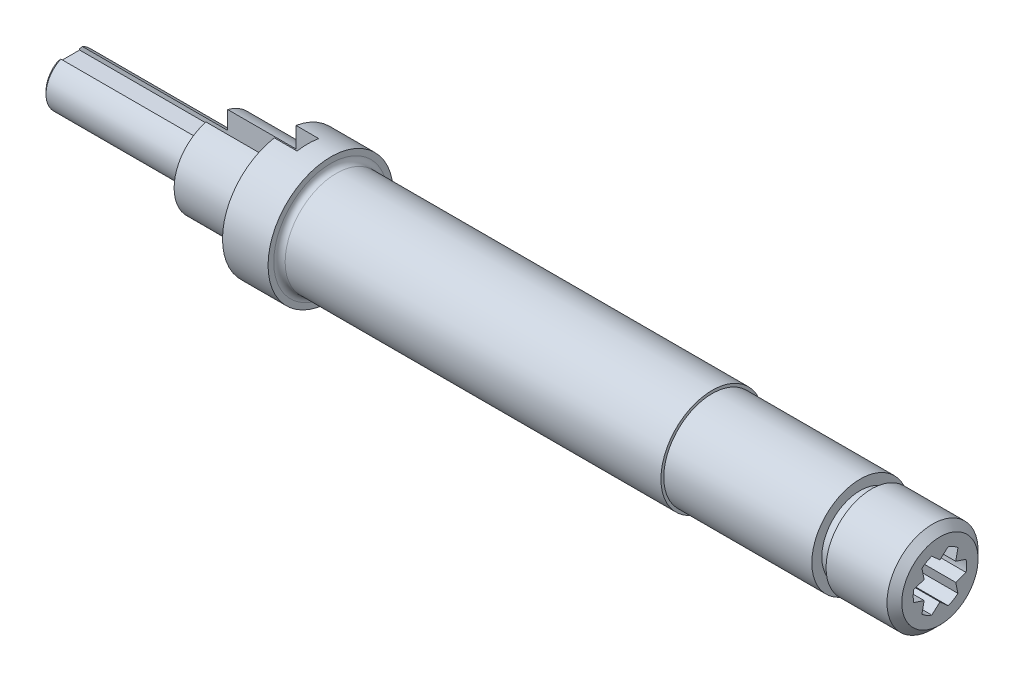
ISO-10303-21;
HEADER;
FILE_DESCRIPTION(('STEP AP214'),'2;1');
FILE_NAME('part.step','',(''),(''),'','','');
FILE_SCHEMA(('AUTOMOTIVE_DESIGN { 1 0 10303 214 1 1 1 1 }'));
ENDSEC;
DATA;
#1=APPLICATION_CONTEXT('core data for automotive mechanical design processes');
#2=APPLICATION_PROTOCOL_DEFINITION('international standard','automotive_design',2000,#1);
#3=PRODUCT_CONTEXT('',#1,'mechanical');
#4=PRODUCT('Part','Part','',(#3));
#5=PRODUCT_RELATED_PRODUCT_CATEGORY('part','',(#4));
#6=PRODUCT_DEFINITION_FORMATION('','',#4);
#7=PRODUCT_DEFINITION_CONTEXT('part definition',#1,'design');
#8=PRODUCT_DEFINITION('design','',#6,#7);
#9=PRODUCT_DEFINITION_SHAPE('','',#8);
#10=(LENGTH_UNIT() NAMED_UNIT(*) SI_UNIT(.MILLI.,.METRE.));
#11=(NAMED_UNIT(*) PLANE_ANGLE_UNIT() SI_UNIT($,.RADIAN.));
#12=(NAMED_UNIT(*) SI_UNIT($,.STERADIAN.) SOLID_ANGLE_UNIT());
#13=UNCERTAINTY_MEASURE_WITH_UNIT(LENGTH_MEASURE(1.E-05),#10,'distance_accuracy_value','');
#14=(GEOMETRIC_REPRESENTATION_CONTEXT(3) GLOBAL_UNCERTAINTY_ASSIGNED_CONTEXT((#13)) GLOBAL_UNIT_ASSIGNED_CONTEXT((#10,
#11,#12)) REPRESENTATION_CONTEXT('',''));
#15=CARTESIAN_POINT('',(0.,0.,0.));
#16=DIRECTION('',(0.,0.,1.));
#17=DIRECTION('',(1.,0.,0.));
#18=AXIS2_PLACEMENT_3D('',#15,#16,#17);
#19=CARTESIAN_POINT('',(0.,0.,0.));
#20=DIRECTION('',(1.,0.,0.));
#21=DIRECTION('',(0.,0.,-1.));
#22=AXIS2_PLACEMENT_3D('',#19,#20,#21);
#23=PLANE('',#22);
#24=DIRECTION('',(0.,0.,1.));
#25=VECTOR('',#24,1.);
#26=CARTESIAN_POINT('',(0.,-3.30000000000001,0.));
#27=LINE('',#26,#25);
#28=CARTESIAN_POINT('',(0.,-3.3,-1.90000000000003));
#29=VERTEX_POINT('',#28);
#30=CARTESIAN_POINT('',(0.,-3.30000000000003,1.89999999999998));
#31=VERTEX_POINT('',#30);
#32=EDGE_CURVE('E626',#29,#31,#27,.T.);
#33=ORIENTED_EDGE('',*,*,#32,.T.);
#34=DIRECTION('',(0.,-1.,0.));
#35=VECTOR('',#34,1.);
#36=CARTESIAN_POINT('',(0.,0.,1.90000000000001));
#37=LINE('',#36,#35);
#38=CARTESIAN_POINT('',(0.,-3.51994318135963,1.89999999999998));
#39=VERTEX_POINT('',#38);
#40=EDGE_CURVE('E467',#31,#39,#37,.T.);
#41=ORIENTED_EDGE('',*,*,#40,.T.);
#42=CARTESIAN_POINT('',(0.,0.,0.));
#43=DIRECTION('',(1.,0.,0.));
#44=DIRECTION('',(0.,0.,-1.));
#45=AXIS2_PLACEMENT_3D('',#42,#43,#44);
#46=CIRCLE('',#45,4.);
#47=CARTESIAN_POINT('',(0.,3.51994318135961,1.90000000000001));
#48=VERTEX_POINT('',#47);
#49=EDGE_CURVE('E66',#39,#48,#46,.F.);
#50=ORIENTED_EDGE('',*,*,#49,.T.);
#51=DIRECTION('',(0.,-1.,0.));
#52=VECTOR('',#51,1.);
#53=CARTESIAN_POINT('',(0.,0.,1.90000000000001));
#54=LINE('',#53,#52);
#55=CARTESIAN_POINT('',(0.,3.30000000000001,1.90000000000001));
#56=VERTEX_POINT('',#55);
#57=EDGE_CURVE('E498',#48,#56,#54,.T.);
#58=ORIENTED_EDGE('',*,*,#57,.T.);
#59=DIRECTION('',(0.,0.,-1.));
#60=VECTOR('',#59,1.);
#61=CARTESIAN_POINT('',(0.,3.30000000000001,0.));
#62=LINE('',#61,#60);
#63=CARTESIAN_POINT('',(0.,3.30000000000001,-1.90000000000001));
#64=VERTEX_POINT('',#63);
#65=EDGE_CURVE('E738',#56,#64,#62,.T.);
#66=ORIENTED_EDGE('',*,*,#65,.T.);
#67=DIRECTION('',(0.,1.,0.));
#68=VECTOR('',#67,1.);
#69=CARTESIAN_POINT('',(0.,0.,-1.90000000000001));
#70=LINE('',#69,#68);
#71=CARTESIAN_POINT('',(0.,3.51994318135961,-1.90000000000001));
#72=VERTEX_POINT('',#71);
#73=EDGE_CURVE('E515',#64,#72,#70,.T.);
#74=ORIENTED_EDGE('',*,*,#73,.T.);
#75=CARTESIAN_POINT('',(0.,-3.5199431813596,-1.90000000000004));
#76=VERTEX_POINT('',#75);
#77=EDGE_CURVE('E573',#72,#76,#46,.F.);
#78=ORIENTED_EDGE('',*,*,#77,.T.);
#79=DIRECTION('',(0.,1.,0.));
#80=VECTOR('',#79,1.);
#81=CARTESIAN_POINT('',(0.,0.,-1.90000000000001));
#82=LINE('',#81,#80);
#83=EDGE_CURVE('E58',#76,#29,#82,.T.);
#84=ORIENTED_EDGE('',*,*,#83,.T.);
#85=EDGE_LOOP('',(#33,#41,#50,#58,#66,#74,#78,#84));
#86=FACE_BOUND('',#85,.T.);
#87=CARTESIAN_POINT('',(0.,0.,0.));
#88=DIRECTION('',(-1.,0.,0.));
#89=DIRECTION('',(0.,0.,1.));
#90=AXIS2_PLACEMENT_3D('',#87,#88,#89);
#91=CIRCLE('',#90,2.5);
#92=CARTESIAN_POINT('',(0.,0.,2.50000000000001));
#93=VERTEX_POINT('',#92);
#94=EDGE_CURVE('E629',#93,#93,#91,.T.);
#95=ORIENTED_EDGE('',*,*,#94,.F.);
#96=EDGE_LOOP('',(#95));
#97=FACE_BOUND('',#96,.T.);
#98=ADVANCED_FACE('F44',(#86,#97),#23,.F.);
#99=CARTESIAN_POINT('',(-30.0039671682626,0.,0.));
#100=DIRECTION('',(-1.,0.,0.));
#101=DIRECTION('',(0.,0.,1.));
#102=AXIS2_PLACEMENT_3D('',#99,#100,#101);
#103=CYLINDRICAL_SURFACE('',#102,4.5);
#104=CARTESIAN_POINT('',(0.5,0.,0.));
#105=DIRECTION('',(1.,0.,0.));
#106=DIRECTION('',(0.,0.,-1.));
#107=AXIS2_PLACEMENT_3D('',#104,#105,#106);
#108=CIRCLE('',#107,4.5);
#109=CARTESIAN_POINT('',(0.5,4.07921561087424,1.90000000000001));
#110=VERTEX_POINT('',#109);
#111=CARTESIAN_POINT('',(0.5,-4.07921561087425,1.89999999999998));
#112=VERTEX_POINT('',#111);
#113=EDGE_CURVE('E577',#110,#112,#108,.T.);
#114=ORIENTED_EDGE('',*,*,#113,.T.);
#115=DIRECTION('',(-1.,0.,0.));
#116=VECTOR('',#115,1.);
#117=CARTESIAN_POINT('',(-30.0039671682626,-4.07921561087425,1.89999999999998));
#118=LINE('',#117,#116);
#119=CARTESIAN_POINT('',(26.,-4.07921561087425,1.89999999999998));
#120=VERTEX_POINT('',#119);
#121=EDGE_CURVE('E464',#112,#120,#118,.F.);
#122=ORIENTED_EDGE('',*,*,#121,.T.);
#123=CARTESIAN_POINT('',(26.,0.,0.));
#124=DIRECTION('',(-1.,0.,0.));
#125=DIRECTION('',(0.,0.,1.));
#126=AXIS2_PLACEMENT_3D('',#123,#124,#125);
#127=CIRCLE('',#126,4.5);
#128=CARTESIAN_POINT('',(26.,4.07921561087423,1.90000000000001));
#129=VERTEX_POINT('',#128);
#130=EDGE_CURVE('E563',#120,#129,#127,.T.);
#131=ORIENTED_EDGE('',*,*,#130,.T.);
#132=DIRECTION('',(-1.,0.,0.));
#133=VECTOR('',#132,1.);
#134=CARTESIAN_POINT('',(-30.0039671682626,4.07921561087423,1.90000000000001));
#135=LINE('',#134,#133);
#136=EDGE_CURVE('E493',#129,#110,#135,.T.);
#137=ORIENTED_EDGE('',*,*,#136,.T.);
#138=EDGE_LOOP('',(#114,#122,#131,#137));
#139=FACE_BOUND('',#138,.T.);
#140=ADVANCED_FACE('F617',(#139),#103,.T.);
#141=CARTESIAN_POINT('',(26.,4.50000000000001,0.));
#142=DIRECTION('',(1.,0.,0.));
#143=DIRECTION('',(0.,0.,-1.));
#144=AXIS2_PLACEMENT_3D('',#141,#142,#143);
#145=PLANE('',#144);
#146=ORIENTED_EDGE('',*,*,#130,.F.);
#147=DIRECTION('',(0.,-1.,0.));
#148=VECTOR('',#147,1.);
#149=CARTESIAN_POINT('',(26.,4.5,1.90000000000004));
#150=LINE('',#149,#148);
#151=CARTESIAN_POINT('',(26.,-7.25534285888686,1.89999999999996));
#152=VERTEX_POINT('',#151);
#153=EDGE_CURVE('E469',#120,#152,#150,.T.);
#154=ORIENTED_EDGE('',*,*,#153,.T.);
#155=CARTESIAN_POINT('',(26.,0.,0.));
#156=DIRECTION('',(-1.,0.,0.));
#157=DIRECTION('',(0.,0.,1.));
#158=AXIS2_PLACEMENT_3D('',#155,#156,#157);
#159=CIRCLE('',#158,7.5);
#160=CARTESIAN_POINT('',(26.,7.25534285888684,1.90000000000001));
#161=VERTEX_POINT('',#160);
#162=EDGE_CURVE('E559',#152,#161,#159,.T.);
#163=ORIENTED_EDGE('',*,*,#162,.T.);
#164=DIRECTION('',(0.,-1.,0.));
#165=VECTOR('',#164,1.);
#166=CARTESIAN_POINT('',(26.,4.50000000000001,1.90000000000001));
#167=LINE('',#166,#165);
#168=EDGE_CURVE('E500',#161,#129,#167,.T.);
#169=ORIENTED_EDGE('',*,*,#168,.T.);
#170=EDGE_LOOP('',(#146,#154,#163,#169));
#171=FACE_BOUND('',#170,.T.);
#172=ADVANCED_FACE('F621',(#171),#145,.F.);
#173=CARTESIAN_POINT('',(-30.0039671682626,0.,0.));
#174=DIRECTION('',(-1.,0.,0.));
#175=DIRECTION('',(0.,0.,1.));
#176=AXIS2_PLACEMENT_3D('',#173,#174,#175);
#177=CYLINDRICAL_SURFACE('',#176,7.5);
#178=ORIENTED_EDGE('',*,*,#162,.F.);
#179=DIRECTION('',(-1.,0.,0.));
#180=VECTOR('',#179,1.);
#181=CARTESIAN_POINT('',(-30.0039671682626,-7.25534285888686,1.89999999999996));
#182=LINE('',#181,#180);
#183=CARTESIAN_POINT('',(38.,-7.25534285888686,1.89999999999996));
#184=VERTEX_POINT('',#183);
#185=EDGE_CURVE('E472',#152,#184,#182,.F.);
#186=ORIENTED_EDGE('',*,*,#185,.T.);
#187=CARTESIAN_POINT('',(38.,0.,0.));
#188=DIRECTION('',(-1.,0.,0.));
#189=DIRECTION('',(0.,0.,1.));
#190=AXIS2_PLACEMENT_3D('',#187,#188,#189);
#191=CIRCLE('',#190,7.5);
#192=CARTESIAN_POINT('',(38.,7.25534285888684,1.90000000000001));
#193=VERTEX_POINT('',#192);
#194=EDGE_CURVE('E555',#184,#193,#191,.T.);
#195=ORIENTED_EDGE('',*,*,#194,.T.);
#196=DIRECTION('',(-1.,0.,0.));
#197=VECTOR('',#196,1.);
#198=CARTESIAN_POINT('',(-30.0039671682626,7.25534285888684,1.90000000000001));
#199=LINE('',#198,#197);
#200=EDGE_CURVE('E503',#193,#161,#199,.T.);
#201=ORIENTED_EDGE('',*,*,#200,.T.);
#202=EDGE_LOOP('',(#178,#186,#195,#201));
#203=FACE_BOUND('',#202,.T.);
#204=ADVANCED_FACE('F756',(#203),#177,.T.);
#205=CARTESIAN_POINT('',(38.,7.50000000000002,0.));
#206=DIRECTION('',(1.,0.,0.));
#207=DIRECTION('',(0.,0.,-1.));
#208=AXIS2_PLACEMENT_3D('',#205,#206,#207);
#209=PLANE('',#208);
#210=ORIENTED_EDGE('',*,*,#194,.F.);
#211=DIRECTION('',(0.,-1.,0.));
#212=VECTOR('',#211,1.);
#213=CARTESIAN_POINT('',(38.,7.50000000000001,1.90000000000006));
#214=LINE('',#213,#212);
#215=CARTESIAN_POINT('',(38.,-10.8346665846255,1.89999999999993));
#216=VERTEX_POINT('',#215);
#217=EDGE_CURVE('E475',#184,#216,#214,.T.);
#218=ORIENTED_EDGE('',*,*,#217,.T.);
#219=CARTESIAN_POINT('',(38.,0.,0.));
#220=DIRECTION('',(-1.,0.,0.));
#221=DIRECTION('',(0.,0.,1.));
#222=AXIS2_PLACEMENT_3D('',#219,#220,#221);
#223=CIRCLE('',#222,11.);
#224=CARTESIAN_POINT('',(38.,10.8346665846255,1.90000000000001));
#225=VERTEX_POINT('',#224);
#226=EDGE_CURVE('E551',#216,#225,#223,.T.);
#227=ORIENTED_EDGE('',*,*,#226,.T.);
#228=DIRECTION('',(0.,-1.,0.));
#229=VECTOR('',#228,1.);
#230=CARTESIAN_POINT('',(38.,7.50000000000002,1.90000000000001));
#231=LINE('',#230,#229);
#232=EDGE_CURVE('E506',#225,#193,#231,.T.);
#233=ORIENTED_EDGE('',*,*,#232,.T.);
#234=EDGE_LOOP('',(#210,#218,#227,#233));
#235=FACE_BOUND('',#234,.T.);
#236=ADVANCED_FACE('F758',(#235),#209,.F.);
#237=CARTESIAN_POINT('',(0.,0.,0.));
#238=DIRECTION('',(1.,0.,0.));
#239=DIRECTION('',(0.,0.,-1.));
#240=AXIS2_PLACEMENT_3D('',#237,#238,#239);
#241=CONICAL_SURFACE('',#240,4.,0.785398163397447);
#242=CARTESIAN_POINT('',(2.20666639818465,-5.90869763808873,1.89999999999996));
#243=CARTESIAN_POINT('',(2.05679091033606,-5.75124247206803,1.89999999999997));
#244=CARTESIAN_POINT('',(1.90718844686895,-5.59352549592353,1.89999999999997));
#245=CARTESIAN_POINT('',(1.60874473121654,-5.2773860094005,1.89999999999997));
#246=CARTESIAN_POINT('',(1.45990344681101,-5.11896352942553,1.89999999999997));
#247=CARTESIAN_POINT('',(1.16329775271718,-4.80133907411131,1.89999999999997));
#248=CARTESIAN_POINT('',(1.01553260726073,-4.64213778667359,1.89999999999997));
#249=CARTESIAN_POINT('',(0.721276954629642,-4.32254070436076,1.89999999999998));
#250=CARTESIAN_POINT('',(0.574786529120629,-4.16214483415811,1.89999999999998));
#251=CARTESIAN_POINT('',(0.283431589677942,-3.83960673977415,1.89999999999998));
#252=CARTESIAN_POINT('',(0.138568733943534,-3.67746301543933,1.89999999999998));
#253=CARTESIAN_POINT('',(-0.148631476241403,-3.35098612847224,1.89999999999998));
#254=CARTESIAN_POINT('',(-0.290969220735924,-3.18665331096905,1.89999999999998));
#255=CARTESIAN_POINT('',(-0.501707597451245,-2.9376833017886,1.89999999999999));
#256=CARTESIAN_POINT('',(-0.571522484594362,-2.85424421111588,1.89999999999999));
#257=CARTESIAN_POINT('',(-0.709953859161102,-2.68638392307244,1.89999999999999));
#258=CARTESIAN_POINT('',(-0.77857041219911,-2.60196277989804,1.89999999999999));
#259=CARTESIAN_POINT('',(-0.914333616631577,-2.43186872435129,1.89999999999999));
#260=CARTESIAN_POINT('',(-0.981479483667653,-2.34619518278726,1.89999999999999));
#261=CARTESIAN_POINT('',(-1.11378611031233,-2.17330571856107,1.89999999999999));
#262=CARTESIAN_POINT('',(-1.17894648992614,-2.08608950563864,1.89999999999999));
#263=CARTESIAN_POINT('',(-1.24286207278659,-1.99795133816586,1.89999999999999));
#264=B_SPLINE_CURVE_WITH_KNOTS('',3,(#242,#243,#244,#245,#246,#247,#248,#249,#250,#251,#252,
#253,#254,#255,#256,#257,#258,#259,#260,#261,#262,#263),.UNSPECIFIED.,.F.,.F.,(4,2,2,2,2,2,2,2,
2,2,4),(0.,0.652146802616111,1.30426576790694,1.95588658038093,2.60754883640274,
3.25982379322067,3.91199710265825,4.23837134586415,4.56472766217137,4.89125399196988,
5.21784242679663),.UNSPECIFIED.);
#265=EDGE_CURVE('E737',#112,#39,#264,.T.);
#266=ORIENTED_EDGE('',*,*,#265,.F.);
#267=ORIENTED_EDGE('',*,*,#113,.F.);
#268=CARTESIAN_POINT('',(-1.58875862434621,1.4846161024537,1.90000000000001));
#269=CARTESIAN_POINT('',(-1.56012440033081,1.53111305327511,1.90000000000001));
#270=CARTESIAN_POINT('',(-1.53089619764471,1.57723806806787,1.90000000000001));
#271=CARTESIAN_POINT('',(-1.47141767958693,1.66881593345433,1.90000000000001));
#272=CARTESIAN_POINT('',(-1.44116750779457,1.71426887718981,1.90000000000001));
#273=CARTESIAN_POINT('',(-1.34915485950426,1.84969580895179,1.90000000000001));
#274=CARTESIAN_POINT('',(-1.28609776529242,1.93878988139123,1.90000000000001));
#275=CARTESIAN_POINT('',(-1.15753954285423,2.11499432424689,1.90000000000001));
#276=CARTESIAN_POINT('',(-1.09204189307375,2.20210725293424,1.90000000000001));
#277=CARTESIAN_POINT('',(-0.95911829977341,2.37486719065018,1.90000000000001));
#278=CARTESIAN_POINT('',(-0.891692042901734,2.460513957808,1.90000000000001));
#279=CARTESIAN_POINT('',(-0.687488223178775,2.71535042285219,1.90000000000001));
#280=CARTESIAN_POINT('',(-0.548525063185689,2.88278540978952,1.90000000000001));
#281=CARTESIAN_POINT('',(-0.266899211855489,3.21460159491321,1.90000000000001));
#282=CARTESIAN_POINT('',(-0.124235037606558,3.37898152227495,1.90000000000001));
#283=CARTESIAN_POINT('',(0.163242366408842,3.70520077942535,1.90000000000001));
#284=CARTESIAN_POINT('',(0.308050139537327,3.86704492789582,1.90000000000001));
#285=CARTESIAN_POINT('',(0.599368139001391,4.18913905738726,1.90000000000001));
#286=CARTESIAN_POINT('',(0.745878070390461,4.3493893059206,1.90000000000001));
#287=CARTESIAN_POINT('',(1.04040648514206,4.66900109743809,1.90000000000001));
#288=CARTESIAN_POINT('',(1.18842711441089,4.82836065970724,1.90000000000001));
#289=CARTESIAN_POINT('',(1.48543401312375,5.14617248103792,1.90000000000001));
#290=CARTESIAN_POINT('',(1.63442026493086,5.30462475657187,1.90000000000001));
#291=CARTESIAN_POINT('',(1.78374384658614,5.46275506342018,1.90000000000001));
#292=B_SPLINE_CURVE_WITH_KNOTS('',3,(#268,#269,#270,#271,#272,#273,#274,#275,#276,#277,#278,
#279,#280,#281,#282,#283,#284,#285,#286,#287,#288,#289,#290,#291),.UNSPECIFIED.,.F.,.F.,(4,2,2,
2,2,2,2,2,2,2,2,4),(0.,0.163807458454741,0.3275919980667,0.654977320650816,0.981912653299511,
1.30890141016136,1.96157287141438,2.61451001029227,3.26600170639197,3.91738214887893,
4.56987302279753,5.22235201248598),.UNSPECIFIED.);
#293=EDGE_CURVE('E580',#48,#110,#292,.T.);
#294=ORIENTED_EDGE('',*,*,#293,.F.);
#295=ORIENTED_EDGE('',*,*,#49,.F.);
#296=EDGE_LOOP('',(#266,#267,#294,#295));
#297=FACE_BOUND('',#296,.T.);
#298=ADVANCED_FACE('F810',(#297),#241,.T.);
#299=CARTESIAN_POINT('',(26.,4.07921561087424,-1.90000000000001));
#300=VERTEX_POINT('',#299);
#301=CARTESIAN_POINT('',(26.,-4.07921561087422,-1.90000000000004));
#302=VERTEX_POINT('',#301);
#303=EDGE_CURVE('E564',#300,#302,#127,.T.);
#304=ORIENTED_EDGE('',*,*,#303,.T.);
#305=DIRECTION('',(-1.,0.,0.));
#306=VECTOR('',#305,1.);
#307=CARTESIAN_POINT('',(-30.0039671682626,-4.07921561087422,-1.90000000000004));
#308=LINE('',#307,#306);
#309=CARTESIAN_POINT('',(0.5,-4.07921561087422,-1.90000000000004));
#310=VERTEX_POINT('',#309);
#311=EDGE_CURVE('E446',#302,#310,#308,.T.);
#312=ORIENTED_EDGE('',*,*,#311,.T.);
#313=CARTESIAN_POINT('',(0.5,4.07921561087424,-1.90000000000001));
#314=VERTEX_POINT('',#313);
#315=EDGE_CURVE('E576',#310,#314,#108,.T.);
#316=ORIENTED_EDGE('',*,*,#315,.T.);
#317=DIRECTION('',(-1.,0.,0.));
#318=VECTOR('',#317,1.);
#319=CARTESIAN_POINT('',(-30.0039671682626,4.07921561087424,-1.90000000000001));
#320=LINE('',#319,#318);
#321=EDGE_CURVE('E512',#314,#300,#320,.F.);
#322=ORIENTED_EDGE('',*,*,#321,.T.);
#323=EDGE_LOOP('',(#304,#312,#316,#322));
#324=FACE_BOUND('',#323,.T.);
#325=ADVANCED_FACE('F623',(#324),#103,.T.);
#326=CARTESIAN_POINT('',(26.,7.25534285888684,-1.90000000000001));
#327=VERTEX_POINT('',#326);
#328=CARTESIAN_POINT('',(26.,-7.25534285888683,-1.90000000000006));
#329=VERTEX_POINT('',#328);
#330=EDGE_CURVE('E560',#327,#329,#159,.T.);
#331=ORIENTED_EDGE('',*,*,#330,.T.);
#332=DIRECTION('',(0.,1.,0.));
#333=VECTOR('',#332,1.);
#334=CARTESIAN_POINT('',(26.,4.50000000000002,-1.89999999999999));
#335=LINE('',#334,#333);
#336=EDGE_CURVE('E452',#329,#302,#335,.T.);
#337=ORIENTED_EDGE('',*,*,#336,.T.);
#338=ORIENTED_EDGE('',*,*,#303,.F.);
#339=DIRECTION('',(0.,1.,0.));
#340=VECTOR('',#339,1.);
#341=CARTESIAN_POINT('',(26.,4.50000000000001,-1.90000000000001));
#342=LINE('',#341,#340);
#343=EDGE_CURVE('E518',#300,#327,#342,.T.);
#344=ORIENTED_EDGE('',*,*,#343,.T.);
#345=EDGE_LOOP('',(#331,#337,#338,#344));
#346=FACE_BOUND('',#345,.T.);
#347=ADVANCED_FACE('F780',(#346),#145,.F.);
#348=CARTESIAN_POINT('',(38.,7.25534285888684,-1.90000000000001));
#349=VERTEX_POINT('',#348);
#350=CARTESIAN_POINT('',(38.,-7.25534285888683,-1.90000000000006));
#351=VERTEX_POINT('',#350);
#352=EDGE_CURVE('E556',#349,#351,#191,.T.);
#353=ORIENTED_EDGE('',*,*,#352,.T.);
#354=DIRECTION('',(-1.,0.,0.));
#355=VECTOR('',#354,1.);
#356=CARTESIAN_POINT('',(-30.0039671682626,-7.25534285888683,-1.90000000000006));
#357=LINE('',#356,#355);
#358=EDGE_CURVE('E455',#351,#329,#357,.T.);
#359=ORIENTED_EDGE('',*,*,#358,.T.);
#360=ORIENTED_EDGE('',*,*,#330,.F.);
#361=DIRECTION('',(-1.,0.,0.));
#362=VECTOR('',#361,1.);
#363=CARTESIAN_POINT('',(-30.0039671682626,7.25534285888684,-1.90000000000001));
#364=LINE('',#363,#362);
#365=EDGE_CURVE('E521',#327,#349,#364,.F.);
#366=ORIENTED_EDGE('',*,*,#365,.T.);
#367=EDGE_LOOP('',(#353,#359,#360,#366));
#368=FACE_BOUND('',#367,.T.);
#369=ADVANCED_FACE('F783',(#368),#177,.T.);
#370=CARTESIAN_POINT('',(38.,10.8346665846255,-1.90000000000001));
#371=VERTEX_POINT('',#370);
#372=CARTESIAN_POINT('',(38.,-10.8346665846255,-1.90000000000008));
#373=VERTEX_POINT('',#372);
#374=EDGE_CURVE('E552',#371,#373,#223,.T.);
#375=ORIENTED_EDGE('',*,*,#374,.T.);
#376=DIRECTION('',(0.,1.,0.));
#377=VECTOR('',#376,1.);
#378=CARTESIAN_POINT('',(38.,7.50000000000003,-1.89999999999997));
#379=LINE('',#378,#377);
#380=EDGE_CURVE('E458',#373,#351,#379,.T.);
#381=ORIENTED_EDGE('',*,*,#380,.T.);
#382=ORIENTED_EDGE('',*,*,#352,.F.);
#383=DIRECTION('',(0.,1.,0.));
#384=VECTOR('',#383,1.);
#385=CARTESIAN_POINT('',(38.,7.50000000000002,-1.90000000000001));
#386=LINE('',#385,#384);
#387=EDGE_CURVE('E524',#349,#371,#386,.T.);
#388=ORIENTED_EDGE('',*,*,#387,.T.);
#389=EDGE_LOOP('',(#375,#381,#382,#388));
#390=FACE_BOUND('',#389,.T.);
#391=ADVANCED_FACE('F786',(#390),#209,.F.);
#392=CARTESIAN_POINT('',(-30.0039671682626,0.,0.));
#393=DIRECTION('',(-1.,0.,0.));
#394=DIRECTION('',(0.,0.,1.));
#395=AXIS2_PLACEMENT_3D('',#392,#393,#394);
#396=CYLINDRICAL_SURFACE('',#395,11.);
#397=ORIENTED_EDGE('',*,*,#226,.F.);
#398=DIRECTION('',(-1.,0.,0.));
#399=VECTOR('',#398,1.);
#400=CARTESIAN_POINT('',(-30.0039671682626,-10.8346665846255,1.89999999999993));
#401=LINE('',#400,#399);
#402=CARTESIAN_POINT('',(42.,-10.8346665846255,1.89999999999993));
#403=VERTEX_POINT('',#402);
#404=EDGE_CURVE('E478',#216,#403,#401,.F.);
#405=ORIENTED_EDGE('',*,*,#404,.T.);
#406=CARTESIAN_POINT('',(42.,0.,0.));
#407=DIRECTION('',(-1.,0.,0.));
#408=DIRECTION('',(0.,0.,1.));
#409=AXIS2_PLACEMENT_3D('',#406,#407,#408);
#410=CIRCLE('',#409,11.);
#411=CARTESIAN_POINT('',(42.,-10.8346665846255,-1.90000000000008));
#412=VERTEX_POINT('',#411);
#413=EDGE_CURVE('E743',#412,#403,#410,.T.);
#414=ORIENTED_EDGE('',*,*,#413,.F.);
#415=DIRECTION('',(-1.,0.,0.));
#416=VECTOR('',#415,1.);
#417=CARTESIAN_POINT('',(-30.0039671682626,-10.8346665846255,-1.90000000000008));
#418=LINE('',#417,#416);
#419=EDGE_CURVE('E461',#412,#373,#418,.T.);
#420=ORIENTED_EDGE('',*,*,#419,.T.);
#421=ORIENTED_EDGE('',*,*,#374,.F.);
#422=DIRECTION('',(-1.,0.,0.));
#423=VECTOR('',#422,1.);
#424=CARTESIAN_POINT('',(-30.0039671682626,10.8346665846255,-1.90000000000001));
#425=LINE('',#424,#423);
#426=CARTESIAN_POINT('',(42.,10.8346665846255,-1.90000000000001));
#427=VERTEX_POINT('',#426);
#428=EDGE_CURVE('E527',#371,#427,#425,.F.);
#429=ORIENTED_EDGE('',*,*,#428,.T.);
#430=CARTESIAN_POINT('',(42.,0.,0.));
#431=DIRECTION('',(-1.,0.,0.));
#432=DIRECTION('',(0.,0.,1.));
#433=AXIS2_PLACEMENT_3D('',#430,#431,#432);
#434=CIRCLE('',#433,11.);
#435=CARTESIAN_POINT('',(42.,10.8346665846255,1.90000000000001));
#436=VERTEX_POINT('',#435);
#437=EDGE_CURVE('E766',#436,#427,#434,.T.);
#438=ORIENTED_EDGE('',*,*,#437,.F.);
#439=DIRECTION('',(-1.,0.,0.));
#440=VECTOR('',#439,1.);
#441=CARTESIAN_POINT('',(-30.0039671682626,10.8346665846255,1.90000000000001));
#442=LINE('',#441,#440);
#443=EDGE_CURVE('E509',#436,#225,#442,.T.);
#444=ORIENTED_EDGE('',*,*,#443,.T.);
#445=EDGE_LOOP('',(#397,#405,#414,#420,#421,#429,#438,#444));
#446=FACE_BOUND('',#445,.T.);
#447=CARTESIAN_POINT('',(46.,0.,0.));
#448=DIRECTION('',(-1.,0.,0.));
#449=DIRECTION('',(0.,0.,1.));
#450=AXIS2_PLACEMENT_3D('',#447,#448,#449);
#451=CIRCLE('',#450,11.);
#452=CARTESIAN_POINT('',(46.,0.,11.));
#453=VERTEX_POINT('',#452);
#454=EDGE_CURVE('E548',#453,#453,#451,.T.);
#455=ORIENTED_EDGE('',*,*,#454,.T.);
#456=EDGE_LOOP('',(#455));
#457=FACE_BOUND('',#456,.T.);
#458=ADVANCED_FACE('F764',(#446,#457),#396,.T.);
#459=CARTESIAN_POINT('',(46.,11.,0.));
#460=DIRECTION('',(-1.,0.,0.));
#461=DIRECTION('',(0.,0.,1.));
#462=AXIS2_PLACEMENT_3D('',#459,#460,#461);
#463=PLANE('',#462);
#464=CARTESIAN_POINT('',(46.,0.,0.));
#465=DIRECTION('',(-1.,0.,0.));
#466=DIRECTION('',(0.,0.,1.));
#467=AXIS2_PLACEMENT_3D('',#464,#465,#466);
#468=CIRCLE('',#467,10.);
#469=CARTESIAN_POINT('',(46.,0.,10.));
#470=VERTEX_POINT('',#469);
#471=EDGE_CURVE('E51',#470,#470,#468,.T.);
#472=ORIENTED_EDGE('',*,*,#471,.T.);
#473=EDGE_LOOP('',(#472));
#474=FACE_BOUND('',#473,.T.);
#475=ORIENTED_EDGE('',*,*,#454,.F.);
#476=EDGE_LOOP('',(#475));
#477=FACE_BOUND('',#476,.T.);
#478=ADVANCED_FACE('F791',(#474,#477),#463,.F.);
#479=CARTESIAN_POINT('',(-30.0039671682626,0.,0.));
#480=DIRECTION('',(-1.,0.,0.));
#481=DIRECTION('',(0.,0.,1.));
#482=AXIS2_PLACEMENT_3D('',#479,#480,#481);
#483=CYLINDRICAL_SURFACE('',#482,9.);
#484=CARTESIAN_POINT('',(47.,0.,0.));
#485=DIRECTION('',(-1.,0.,0.));
#486=DIRECTION('',(0.,0.,1.));
#487=AXIS2_PLACEMENT_3D('',#484,#485,#486);
#488=CIRCLE('',#487,9.);
#489=CARTESIAN_POINT('',(47.,0.,9.00000000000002));
#490=VERTEX_POINT('',#489);
#491=EDGE_CURVE('E14',#490,#490,#488,.F.);
#492=ORIENTED_EDGE('',*,*,#491,.T.);
#493=EDGE_LOOP('',(#492));
#494=FACE_BOUND('',#493,.T.);
#495=CARTESIAN_POINT('',(113.,0.,0.));
#496=DIRECTION('',(-1.,0.,0.));
#497=DIRECTION('',(0.,0.,1.));
#498=AXIS2_PLACEMENT_3D('',#495,#496,#497);
#499=CIRCLE('',#498,9.);
#500=CARTESIAN_POINT('',(113.,0.,9.00000000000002));
#501=VERTEX_POINT('',#500);
#502=EDGE_CURVE('E545',#501,#501,#499,.T.);
#503=ORIENTED_EDGE('',*,*,#502,.T.);
#504=EDGE_LOOP('',(#503));
#505=FACE_BOUND('',#504,.T.);
#506=ADVANCED_FACE('F795',(#494,#505),#483,.T.);
#507=CARTESIAN_POINT('',(113.,9.00000000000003,0.));
#508=DIRECTION('',(-1.,0.,0.));
#509=DIRECTION('',(0.,0.,1.));
#510=AXIS2_PLACEMENT_3D('',#507,#508,#509);
#511=PLANE('',#510);
#512=ORIENTED_EDGE('',*,*,#502,.F.);
#513=EDGE_LOOP('',(#512));
#514=FACE_BOUND('',#513,.T.);
#515=CARTESIAN_POINT('',(113.,0.,0.));
#516=DIRECTION('',(-1.,0.,0.));
#517=DIRECTION('',(0.,0.,1.));
#518=AXIS2_PLACEMENT_3D('',#515,#516,#517);
#519=CIRCLE('',#518,8.5);
#520=CARTESIAN_POINT('',(113.,0.,8.50000000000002));
#521=VERTEX_POINT('',#520);
#522=EDGE_CURVE('E542',#521,#521,#519,.T.);
#523=ORIENTED_EDGE('',*,*,#522,.T.);
#524=EDGE_LOOP('',(#523));
#525=FACE_BOUND('',#524,.T.);
#526=ADVANCED_FACE('F851',(#514,#525),#511,.F.);
#527=CARTESIAN_POINT('',(-30.0039671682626,0.,0.));
#528=DIRECTION('',(-1.,0.,0.));
#529=DIRECTION('',(0.,0.,1.));
#530=AXIS2_PLACEMENT_3D('',#527,#528,#529);
#531=CYLINDRICAL_SURFACE('',#530,8.5);
#532=ORIENTED_EDGE('',*,*,#522,.F.);
#533=EDGE_LOOP('',(#532));
#534=FACE_BOUND('',#533,.T.);
#535=CARTESIAN_POINT('',(139.,0.,0.));
#536=DIRECTION('',(-1.,0.,0.));
#537=DIRECTION('',(0.,0.,1.));
#538=AXIS2_PLACEMENT_3D('',#535,#536,#537);
#539=CIRCLE('',#538,8.5);
#540=CARTESIAN_POINT('',(139.,0.,8.50000000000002));
#541=VERTEX_POINT('',#540);
#542=EDGE_CURVE('E539',#541,#541,#539,.T.);
#543=ORIENTED_EDGE('',*,*,#542,.T.);
#544=EDGE_LOOP('',(#543));
#545=FACE_BOUND('',#544,.T.);
#546=ADVANCED_FACE('F847',(#534,#545),#531,.T.);
#547=CARTESIAN_POINT('',(139.,8.50000000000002,0.));
#548=DIRECTION('',(-1.,0.,0.));
#549=DIRECTION('',(0.,0.,1.));
#550=AXIS2_PLACEMENT_3D('',#547,#548,#549);
#551=PLANE('',#550);
#552=ORIENTED_EDGE('',*,*,#542,.F.);
#553=EDGE_LOOP('',(#552));
#554=FACE_BOUND('',#553,.T.);
#555=CARTESIAN_POINT('',(139.,0.,0.));
#556=DIRECTION('',(-1.,0.,0.));
#557=DIRECTION('',(0.,0.,1.));
#558=AXIS2_PLACEMENT_3D('',#555,#556,#557);
#559=CIRCLE('',#558,6.75);
#560=CARTESIAN_POINT('',(139.,0.,6.75000000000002));
#561=VERTEX_POINT('',#560);
#562=EDGE_CURVE('E536',#561,#561,#559,.T.);
#563=ORIENTED_EDGE('',*,*,#562,.T.);
#564=EDGE_LOOP('',(#563));
#565=FACE_BOUND('',#564,.T.);
#566=ADVANCED_FACE('F843',(#554,#565),#551,.F.);
#567=CARTESIAN_POINT('',(-30.0039671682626,0.,0.));
#568=DIRECTION('',(-1.,0.,0.));
#569=DIRECTION('',(0.,0.,1.));
#570=AXIS2_PLACEMENT_3D('',#567,#568,#569);
#571=CYLINDRICAL_SURFACE('',#570,6.75);
#572=ORIENTED_EDGE('',*,*,#562,.F.);
#573=EDGE_LOOP('',(#572));
#574=FACE_BOUND('',#573,.T.);
#575=CARTESIAN_POINT('',(141.,0.,0.));
#576=DIRECTION('',(-1.,0.,0.));
#577=DIRECTION('',(0.,0.,1.));
#578=AXIS2_PLACEMENT_3D('',#575,#576,#577);
#579=CIRCLE('',#578,6.75);
#580=CARTESIAN_POINT('',(141.,0.,6.75000000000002));
#581=VERTEX_POINT('',#580);
#582=EDGE_CURVE('E533',#581,#581,#579,.T.);
#583=ORIENTED_EDGE('',*,*,#582,.T.);
#584=EDGE_LOOP('',(#583));
#585=FACE_BOUND('',#584,.T.);
#586=ADVANCED_FACE('F839',(#574,#585),#571,.T.);
#587=CARTESIAN_POINT('',(141.,6.75000000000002,0.));
#588=DIRECTION('',(1.,0.,0.));
#589=DIRECTION('',(0.,0.,-1.));
#590=AXIS2_PLACEMENT_3D('',#587,#588,#589);
#591=PLANE('',#590);
#592=ORIENTED_EDGE('',*,*,#582,.F.);
#593=EDGE_LOOP('',(#592));
#594=FACE_BOUND('',#593,.T.);
#595=CARTESIAN_POINT('',(141.,0.,0.));
#596=DIRECTION('',(-1.,0.,0.));
#597=DIRECTION('',(0.,0.,1.));
#598=AXIS2_PLACEMENT_3D('',#595,#596,#597);
#599=CIRCLE('',#598,8.);
#600=CARTESIAN_POINT('',(141.,0.,8.00000000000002));
#601=VERTEX_POINT('',#600);
#602=EDGE_CURVE('E530',#601,#601,#599,.T.);
#603=ORIENTED_EDGE('',*,*,#602,.T.);
#604=EDGE_LOOP('',(#603));
#605=FACE_BOUND('',#604,.T.);
#606=ADVANCED_FACE('F835',(#594,#605),#591,.F.);
#607=CARTESIAN_POINT('',(-30.0039671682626,0.,0.));
#608=DIRECTION('',(-1.,0.,0.));
#609=DIRECTION('',(0.,0.,1.));
#610=AXIS2_PLACEMENT_3D('',#607,#608,#609);
#611=CYLINDRICAL_SURFACE('',#610,8.);
#612=CARTESIAN_POINT('',(151.7,0.,0.));
#613=DIRECTION('',(-1.,0.,0.));
#614=DIRECTION('',(0.,0.,1.));
#615=AXIS2_PLACEMENT_3D('',#612,#613,#614);
#616=CIRCLE('',#615,8.);
#617=CARTESIAN_POINT('',(151.7,0.,8.00000000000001));
#618=VERTEX_POINT('',#617);
#619=EDGE_CURVE('E567',#618,#618,#616,.T.);
#620=ORIENTED_EDGE('',*,*,#619,.T.);
#621=EDGE_LOOP('',(#620));
#622=FACE_BOUND('',#621,.T.);
#623=ORIENTED_EDGE('',*,*,#602,.F.);
#624=EDGE_LOOP('',(#623));
#625=FACE_BOUND('',#624,.T.);
#626=ADVANCED_FACE('F828',(#622,#625),#611,.T.);
#627=CARTESIAN_POINT('',(153.,8.00000000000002,0.));
#628=DIRECTION('',(-1.,0.,0.));
#629=DIRECTION('',(0.,0.,1.));
#630=AXIS2_PLACEMENT_3D('',#627,#628,#629);
#631=PLANE('',#630);
#632=CARTESIAN_POINT('',(153.,0.,0.));
#633=DIRECTION('',(1.,0.,0.));
#634=DIRECTION('',(0.,0.866025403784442,-0.499999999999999));
#635=AXIS2_PLACEMENT_3D('',#632,#633,#634);
#636=CIRCLE('',#635,4.7);
#637=CARTESIAN_POINT('',(153.,-3.47712207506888,3.16221790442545));
#638=VERTEX_POINT('',#637);
#639=CARTESIAN_POINT('',(153.,-4.47712207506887,1.43016709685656));
#640=VERTEX_POINT('',#639);
#641=EDGE_CURVE('E387',#638,#640,#636,.T.);
#642=ORIENTED_EDGE('',*,*,#641,.F.);
#643=DIRECTION('',(0.,-0.9789940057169,0.203889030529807));
#644=VECTOR('',#643,1.);
#645=CARTESIAN_POINT('',(153.,-1.60000000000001,2.7712812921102));
#646=LINE('',#645,#644);
#647=CARTESIAN_POINT('',(153.,-1.60000000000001,2.7712812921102));
#648=VERTEX_POINT('',#647);
#649=EDGE_CURVE('E381',#648,#638,#646,.T.);
#650=ORIENTED_EDGE('',*,*,#649,.F.);
#651=DIRECTION('',(0.,-0.312923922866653,-0.949778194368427));
#652=VECTOR('',#651,1.);
#653=CARTESIAN_POINT('',(153.,-1.60000000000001,2.77128129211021));
#654=LINE('',#653,#652);
#655=CARTESIAN_POINT('',(153.,-1.,4.59238500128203));
#656=VERTEX_POINT('',#655);
#657=EDGE_CURVE('E414',#656,#648,#654,.T.);
#658=ORIENTED_EDGE('',*,*,#657,.F.);
#659=CARTESIAN_POINT('',(153.,0.,0.));
#660=DIRECTION('',(1.,0.,0.));
#661=DIRECTION('',(0.,0.,-1.));
#662=AXIS2_PLACEMENT_3D('',#659,#660,#661);
#663=CIRCLE('',#662,4.7);
#664=CARTESIAN_POINT('',(153.,1.,4.59238500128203));
#665=VERTEX_POINT('',#664);
#666=EDGE_CURVE('E411',#665,#656,#663,.T.);
#667=ORIENTED_EDGE('',*,*,#666,.F.);
#668=DIRECTION('',(0.,-0.312923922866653,0.949778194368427));
#669=VECTOR('',#668,1.);
#670=CARTESIAN_POINT('',(153.,1.6,2.77128129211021));
#671=LINE('',#670,#669);
#672=CARTESIAN_POINT('',(153.,1.59999999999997,2.77128129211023));
#673=VERTEX_POINT('',#672);
#674=EDGE_CURVE('E405',#673,#665,#671,.T.);
#675=ORIENTED_EDGE('',*,*,#674,.F.);
#676=DIRECTION('',(0.,-0.978994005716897,-0.203889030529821));
#677=VECTOR('',#676,1.);
#678=CARTESIAN_POINT('',(153.,1.59999999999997,2.77128129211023));
#679=LINE('',#678,#677);
#680=CARTESIAN_POINT('',(153.,3.47712207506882,3.16221790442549));
#681=VERTEX_POINT('',#680);
#682=EDGE_CURVE('E307',#681,#673,#679,.T.);
#683=ORIENTED_EDGE('',*,*,#682,.F.);
#684=CARTESIAN_POINT('',(153.,0.,0.));
#685=DIRECTION('',(1.,0.,0.));
#686=DIRECTION('',(0.,-0.866025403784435,-0.500000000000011));
#687=AXIS2_PLACEMENT_3D('',#684,#685,#686);
#688=CIRCLE('',#687,4.7);
#689=CARTESIAN_POINT('',(153.,4.47712207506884,1.43016709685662));
#690=VERTEX_POINT('',#689);
#691=EDGE_CURVE('E283',#690,#681,#688,.T.);
#692=ORIENTED_EDGE('',*,*,#691,.F.);
#693=DIRECTION('',(0.,0.666070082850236,0.745889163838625));
#694=VECTOR('',#693,1.);
#695=CARTESIAN_POINT('',(153.,3.2,0.));
#696=LINE('',#695,#694);
#697=CARTESIAN_POINT('',(153.,3.2,0.));
#698=VERTEX_POINT('',#697);
#699=EDGE_CURVE('E294',#698,#690,#696,.T.);
#700=ORIENTED_EDGE('',*,*,#699,.F.);
#701=DIRECTION('',(0.,-0.666070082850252,0.745889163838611));
#702=VECTOR('',#701,1.);
#703=CARTESIAN_POINT('',(153.,3.2,0.));
#704=LINE('',#703,#702);
#705=CARTESIAN_POINT('',(153.,4.47712207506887,-1.43016709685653));
#706=VERTEX_POINT('',#705);
#707=EDGE_CURVE('E323',#706,#698,#704,.T.);
#708=ORIENTED_EDGE('',*,*,#707,.F.);
#709=CARTESIAN_POINT('',(153.,0.,0.));
#710=DIRECTION('',(1.,0.,0.));
#711=DIRECTION('',(0.,-0.866025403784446,0.499999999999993));
#712=AXIS2_PLACEMENT_3D('',#709,#710,#711);
#713=CIRCLE('',#712,4.7);
#714=CARTESIAN_POINT('',(153.,3.47712207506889,-3.16221790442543));
#715=VERTEX_POINT('',#714);
#716=EDGE_CURVE('E320',#715,#706,#713,.T.);
#717=ORIENTED_EDGE('',*,*,#716,.F.);
#718=DIRECTION('',(0.,0.978994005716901,-0.2038890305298));
#719=VECTOR('',#718,1.);
#720=CARTESIAN_POINT('',(153.,1.60000000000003,-2.7712812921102));
#721=LINE('',#720,#719);
#722=CARTESIAN_POINT('',(153.,1.60000000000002,-2.7712812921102));
#723=VERTEX_POINT('',#722);
#724=EDGE_CURVE('E316',#723,#715,#721,.T.);
#725=ORIENTED_EDGE('',*,*,#724,.F.);
#726=DIRECTION('',(0.,0.312923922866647,0.94977819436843));
#727=VECTOR('',#726,1.);
#728=CARTESIAN_POINT('',(153.,1.60000000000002,-2.7712812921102));
#729=LINE('',#728,#727);
#730=CARTESIAN_POINT('',(153.,1.00000000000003,-4.59238500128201));
#731=VERTEX_POINT('',#730);
#732=EDGE_CURVE('E344',#731,#723,#729,.T.);
#733=ORIENTED_EDGE('',*,*,#732,.F.);
#734=CARTESIAN_POINT('',(153.,0.,0.));
#735=DIRECTION('',(1.,0.,0.));
#736=DIRECTION('',(0.,0.,1.));
#737=AXIS2_PLACEMENT_3D('',#734,#735,#736);
#738=CIRCLE('',#737,4.7);
#739=CARTESIAN_POINT('',(153.,-0.999999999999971,-4.59238500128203));
#740=VERTEX_POINT('',#739);
#741=EDGE_CURVE('E341',#740,#731,#738,.T.);
#742=ORIENTED_EDGE('',*,*,#741,.F.);
#743=DIRECTION('',(0.,0.31292392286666,-0.949778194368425));
#744=VECTOR('',#743,1.);
#745=CARTESIAN_POINT('',(153.,-1.59999999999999,-2.77128129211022));
#746=LINE('',#745,#744);
#747=CARTESIAN_POINT('',(153.,-1.59999999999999,-2.77128129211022));
#748=VERTEX_POINT('',#747);
#749=EDGE_CURVE('E335',#748,#740,#746,.T.);
#750=ORIENTED_EDGE('',*,*,#749,.F.);
#751=DIRECTION('',(0.,0.978994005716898,0.203889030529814));
#752=VECTOR('',#751,1.);
#753=CARTESIAN_POINT('',(153.,-1.59999999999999,-2.77128129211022));
#754=LINE('',#753,#752);
#755=CARTESIAN_POINT('',(153.,-3.47712207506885,-3.16221790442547));
#756=VERTEX_POINT('',#755);
#757=EDGE_CURVE('E367',#756,#748,#754,.T.);
#758=ORIENTED_EDGE('',*,*,#757,.F.);
#759=CARTESIAN_POINT('',(153.,0.,0.));
#760=DIRECTION('',(1.,0.,0.));
#761=DIRECTION('',(0.,0.866025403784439,0.500000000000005));
#762=AXIS2_PLACEMENT_3D('',#759,#760,#761);
#763=CIRCLE('',#762,4.7);
#764=CARTESIAN_POINT('',(153.,-4.47712207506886,-1.43016709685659));
#765=VERTEX_POINT('',#764);
#766=EDGE_CURVE('E364',#765,#756,#763,.T.);
#767=ORIENTED_EDGE('',*,*,#766,.F.);
#768=DIRECTION('',(0.,-0.666070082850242,-0.74588916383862));
#769=VECTOR('',#768,1.);
#770=CARTESIAN_POINT('',(153.,-3.20000000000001,0.));
#771=LINE('',#770,#769);
#772=CARTESIAN_POINT('',(153.,-3.20000000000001,0.));
#773=VERTEX_POINT('',#772);
#774=EDGE_CURVE('E358',#773,#765,#771,.T.);
#775=ORIENTED_EDGE('',*,*,#774,.F.);
#776=DIRECTION('',(0.,0.666070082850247,-0.745889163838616));
#777=VECTOR('',#776,1.);
#778=CARTESIAN_POINT('',(153.,-3.20000000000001,0.));
#779=LINE('',#778,#777);
#780=EDGE_CURVE('E390',#640,#773,#779,.T.);
#781=ORIENTED_EDGE('',*,*,#780,.F.);
#782=EDGE_LOOP('',(#642,#650,#658,#667,#675,#683,#692,#700,#708,#717,#725,#733,#742,#750,#758,
#767,#775,#781));
#783=FACE_BOUND('',#782,.T.);
#784=CARTESIAN_POINT('',(153.,0.,0.));
#785=DIRECTION('',(-1.,0.,0.));
#786=DIRECTION('',(0.,0.,1.));
#787=AXIS2_PLACEMENT_3D('',#784,#785,#786);
#788=CIRCLE('',#787,6.7);
#789=CARTESIAN_POINT('',(153.,0.,6.70000000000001));
#790=VERTEX_POINT('',#789);
#791=EDGE_CURVE('E570',#790,#790,#788,.F.);
#792=ORIENTED_EDGE('',*,*,#791,.T.);
#793=EDGE_LOOP('',(#792));
#794=FACE_BOUND('',#793,.T.);
#795=ADVANCED_FACE('F304',(#783,#794),#631,.F.);
#796=CARTESIAN_POINT('',(151.7,0.,0.));
#797=DIRECTION('',(-1.,0.,0.));
#798=DIRECTION('',(0.,0.,1.));
#799=AXIS2_PLACEMENT_3D('',#796,#797,#798);
#800=CONICAL_SURFACE('',#799,8.,0.785398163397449);
#801=CARTESIAN_POINT('',(153.,0.,6.70000000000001));
#802=CARTESIAN_POINT('',(152.986458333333,0.,6.71354166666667));
#803=CARTESIAN_POINT('',(152.972916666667,0.,6.72708333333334));
#804=CARTESIAN_POINT('',(152.945833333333,0.,6.75416666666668));
#805=CARTESIAN_POINT('',(152.932291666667,0.,6.76770833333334));
#806=CARTESIAN_POINT('',(152.905208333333,0.,6.79479166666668));
#807=CARTESIAN_POINT('',(152.891666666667,0.,6.80833333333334));
#808=CARTESIAN_POINT('',(152.864583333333,0.,6.83541666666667));
#809=CARTESIAN_POINT('',(152.851041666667,0.,6.84895833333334));
#810=CARTESIAN_POINT('',(152.823958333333,0.,6.87604166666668));
#811=CARTESIAN_POINT('',(152.810416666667,0.,6.88958333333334));
#812=CARTESIAN_POINT('',(152.783333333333,0.,6.91666666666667));
#813=CARTESIAN_POINT('',(152.769791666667,0.,6.93020833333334));
#814=CARTESIAN_POINT('',(152.742708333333,0.,6.95729166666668));
#815=CARTESIAN_POINT('',(152.729166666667,0.,6.97083333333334));
#816=CARTESIAN_POINT('',(152.702083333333,0.,6.99791666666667));
#817=CARTESIAN_POINT('',(152.688541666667,0.,7.01145833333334));
#818=CARTESIAN_POINT('',(152.661458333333,0.,7.03854166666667));
#819=CARTESIAN_POINT('',(152.647916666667,0.,7.05208333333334));
#820=CARTESIAN_POINT('',(152.620833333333,0.,7.07916666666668));
#821=CARTESIAN_POINT('',(152.607291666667,0.,7.09270833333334));
#822=CARTESIAN_POINT('',(152.580208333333,0.,7.11979166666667));
#823=CARTESIAN_POINT('',(152.566666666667,0.,7.13333333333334));
#824=CARTESIAN_POINT('',(152.539583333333,0.,7.16041666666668));
#825=CARTESIAN_POINT('',(152.526041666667,0.,7.17395833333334));
#826=CARTESIAN_POINT('',(152.498958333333,0.,7.20104166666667));
#827=CARTESIAN_POINT('',(152.485416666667,0.,7.21458333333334));
#828=CARTESIAN_POINT('',(152.458333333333,0.,7.24166666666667));
#829=CARTESIAN_POINT('',(152.444791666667,0.,7.25520833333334));
#830=CARTESIAN_POINT('',(152.417708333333,0.,7.28229166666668));
#831=CARTESIAN_POINT('',(152.404166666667,0.,7.29583333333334));
#832=CARTESIAN_POINT('',(152.377083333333,0.,7.32291666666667));
#833=CARTESIAN_POINT('',(152.363541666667,0.,7.33645833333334));
#834=CARTESIAN_POINT('',(152.336458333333,0.,7.36354166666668));
#835=CARTESIAN_POINT('',(152.322916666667,0.,7.37708333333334));
#836=CARTESIAN_POINT('',(152.295833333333,0.,7.40416666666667));
#837=CARTESIAN_POINT('',(152.282291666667,0.,7.41770833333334));
#838=CARTESIAN_POINT('',(152.255208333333,0.,7.44479166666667));
#839=CARTESIAN_POINT('',(152.241666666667,0.,7.45833333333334));
#840=CARTESIAN_POINT('',(152.214583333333,0.,7.48541666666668));
#841=CARTESIAN_POINT('',(152.201041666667,0.,7.49895833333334));
#842=CARTESIAN_POINT('',(152.173958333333,0.,7.52604166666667));
#843=CARTESIAN_POINT('',(152.160416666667,0.,7.53958333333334));
#844=CARTESIAN_POINT('',(152.133333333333,0.,7.56666666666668));
#845=CARTESIAN_POINT('',(152.119791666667,0.,7.58020833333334));
#846=CARTESIAN_POINT('',(152.092708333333,0.,7.60729166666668));
#847=CARTESIAN_POINT('',(152.079166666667,0.,7.62083333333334));
#848=CARTESIAN_POINT('',(152.052083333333,0.,7.64791666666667));
#849=CARTESIAN_POINT('',(152.038541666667,0.,7.66145833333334));
#850=CARTESIAN_POINT('',(152.011458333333,0.,7.68854166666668));
#851=CARTESIAN_POINT('',(151.997916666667,0.,7.70208333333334));
#852=CARTESIAN_POINT('',(151.970833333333,0.,7.72916666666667));
#853=CARTESIAN_POINT('',(151.957291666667,0.,7.74270833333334));
#854=CARTESIAN_POINT('',(151.930208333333,0.,7.76979166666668));
#855=CARTESIAN_POINT('',(151.916666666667,0.,7.78333333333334));
#856=CARTESIAN_POINT('',(151.889583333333,0.,7.81041666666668));
#857=CARTESIAN_POINT('',(151.876041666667,0.,7.82395833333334));
#858=CARTESIAN_POINT('',(151.848958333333,0.,7.85104166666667));
#859=CARTESIAN_POINT('',(151.835416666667,0.,7.86458333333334));
#860=CARTESIAN_POINT('',(151.808333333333,0.,7.89166666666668));
#861=CARTESIAN_POINT('',(151.794791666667,0.,7.90520833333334));
#862=CARTESIAN_POINT('',(151.767708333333,0.,7.93229166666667));
#863=CARTESIAN_POINT('',(151.754166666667,0.,7.94583333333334));
#864=CARTESIAN_POINT('',(151.727083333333,0.,7.97291666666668));
#865=CARTESIAN_POINT('',(151.713541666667,0.,7.98645833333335));
#866=CARTESIAN_POINT('',(151.7,0.,8.00000000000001));
#867=B_SPLINE_CURVE_WITH_KNOTS('',3,(#801,#802,#803,#804,#805,#806,#807,#808,#809,#810,#811,
#812,#813,#814,#815,#816,#817,#818,#819,#820,#821,#822,#823,#824,#825,#826,#827,#828,#829,#830,
#831,#832,#833,#834,#835,#836,#837,#838,#839,#840,#841,#842,#843,#844,#845,#846,#847,#848,#849,
#850,#851,#852,#853,#854,#855,#856,#857,#858,#859,#860,#861,#862,#863,#864,#865,#866),
.UNSPECIFIED.,.F.,.F.,(4,2,2,2,2,2,2,2,2,2,2,2,2,2,2,2,2,2,2,2,2,2,2,2,2,2,2,2,2,2,2,2,4),(0.,
0.0574524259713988,0.114904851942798,0.172357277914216,0.229809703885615,0.287262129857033,
0.344714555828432,0.402166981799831,0.45961940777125,0.517071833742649,0.574524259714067,
0.631976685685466,0.689429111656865,0.746881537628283,0.804333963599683,0.861786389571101,
0.919238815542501,0.976691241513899,1.03414366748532,1.09159609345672,1.14904851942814,
1.20650094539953,1.26395337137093,1.32140579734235,1.37885822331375,1.43631064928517,
1.49376307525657,1.55121550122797,1.60866792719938,1.66612035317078,1.7235727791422,
1.7810252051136,1.83847763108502),.UNSPECIFIED.);
#868=EDGE_CURVE('BSEAM820',#790,#618,#867,.T.);
#869=ORIENTED_EDGE('',*,*,#791,.F.);
#870=ORIENTED_EDGE('',*,*,#619,.F.);
#871=ORIENTED_EDGE('',*,*,#868,.T.);
#872=ORIENTED_EDGE('',*,*,#868,.F.);
#873=EDGE_LOOP('',(#869,#871,#870,#872));
#874=FACE_BOUND('',#873,.T.);
#875=ADVANCED_FACE('F820',(#874),#800,.T.);
#876=CARTESIAN_POINT('',(-1.24286207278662,-1.9979513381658,-1.90000000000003));
#877=CARTESIAN_POINT('',(-1.17894648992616,-2.08608950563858,-1.90000000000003));
#878=CARTESIAN_POINT('',(-1.11378611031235,-2.17330571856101,-1.90000000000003));
#879=CARTESIAN_POINT('',(-0.981479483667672,-2.34619518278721,-1.90000000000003));
#880=CARTESIAN_POINT('',(-0.914333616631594,-2.43186872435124,-1.90000000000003));
#881=CARTESIAN_POINT('',(-0.778570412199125,-2.601962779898,-1.90000000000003));
#882=CARTESIAN_POINT('',(-0.709953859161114,-2.68638392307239,-1.90000000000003));
#883=CARTESIAN_POINT('',(-0.57152248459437,-2.85424421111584,-1.90000000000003));
#884=CARTESIAN_POINT('',(-0.501707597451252,-2.93768330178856,-1.90000000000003));
#885=CARTESIAN_POINT('',(-0.290969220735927,-3.18665331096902,-1.90000000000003));
#886=CARTESIAN_POINT('',(-0.148631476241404,-3.35098612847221,-1.90000000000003));
#887=CARTESIAN_POINT('',(0.138568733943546,-3.67746301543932,-1.90000000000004));
#888=CARTESIAN_POINT('',(0.283431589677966,-3.83960673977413,-1.90000000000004));
#889=CARTESIAN_POINT('',(0.574786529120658,-4.16214483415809,-1.90000000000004));
#890=CARTESIAN_POINT('',(0.721276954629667,-4.32254070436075,-1.90000000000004));
#891=CARTESIAN_POINT('',(1.01553260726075,-4.64213778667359,-1.90000000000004));
#892=CARTESIAN_POINT('',(1.16329775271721,-4.80133907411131,-1.90000000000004));
#893=CARTESIAN_POINT('',(1.45990344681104,-5.11896352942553,-1.90000000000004));
#894=CARTESIAN_POINT('',(1.60874473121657,-5.2773860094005,-1.90000000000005));
#895=CARTESIAN_POINT('',(1.90718844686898,-5.59352549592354,-1.90000000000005));
#896=CARTESIAN_POINT('',(2.05679091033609,-5.75124247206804,-1.90000000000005));
#897=CARTESIAN_POINT('',(2.20666639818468,-5.90869763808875,-1.90000000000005));
#898=B_SPLINE_CURVE_WITH_KNOTS('',3,(#876,#877,#878,#879,#880,#881,#882,#883,#884,#885,#886,
#887,#888,#889,#890,#891,#892,#893,#894,#895,#896,#897),.UNSPECIFIED.,.F.,.F.,(4,2,2,2,2,2,2,2,
2,2,4),(0.,0.32658843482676,0.653114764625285,0.979471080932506,1.30584532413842,
1.95801863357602,2.61029359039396,3.26195584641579,3.91357665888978,4.56569562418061,
5.21784242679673),.UNSPECIFIED.);
#899=EDGE_CURVE('E731',#76,#310,#898,.T.);
#900=ORIENTED_EDGE('',*,*,#899,.F.);
#901=ORIENTED_EDGE('',*,*,#77,.F.);
#902=CARTESIAN_POINT('',(1.78374384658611,5.46275506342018,-1.90000000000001));
#903=CARTESIAN_POINT('',(1.63442026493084,5.30462475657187,-1.90000000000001));
#904=CARTESIAN_POINT('',(1.48543401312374,5.14617248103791,-1.90000000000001));
#905=CARTESIAN_POINT('',(1.18842711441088,4.82836065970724,-1.90000000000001));
#906=CARTESIAN_POINT('',(1.04040648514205,4.66900109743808,-1.90000000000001));
#907=CARTESIAN_POINT('',(0.745878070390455,4.3493893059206,-1.90000000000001));
#908=CARTESIAN_POINT('',(0.599368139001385,4.18913905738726,-1.90000000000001));
#909=CARTESIAN_POINT('',(0.308050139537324,3.86704492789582,-1.90000000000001));
#910=CARTESIAN_POINT('',(0.163242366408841,3.70520077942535,-1.90000000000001));
#911=CARTESIAN_POINT('',(-0.124235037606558,3.37898152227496,-1.90000000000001));
#912=CARTESIAN_POINT('',(-0.266899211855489,3.21460159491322,-1.90000000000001));
#913=CARTESIAN_POINT('',(-0.54852506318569,2.88278540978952,-1.90000000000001));
#914=CARTESIAN_POINT('',(-0.687488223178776,2.7153504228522,-1.90000000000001));
#915=CARTESIAN_POINT('',(-0.891692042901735,2.46051395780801,-1.90000000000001));
#916=CARTESIAN_POINT('',(-0.959118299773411,2.37486719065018,-1.90000000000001));
#917=CARTESIAN_POINT('',(-1.09204189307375,2.20210725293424,-1.90000000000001));
#918=CARTESIAN_POINT('',(-1.15753954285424,2.1149943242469,-1.90000000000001));
#919=CARTESIAN_POINT('',(-1.28609776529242,1.93878988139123,-1.90000000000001));
#920=CARTESIAN_POINT('',(-1.34915485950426,1.8496958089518,-1.90000000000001));
#921=CARTESIAN_POINT('',(-1.44116750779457,1.71426887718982,-1.90000000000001));
#922=CARTESIAN_POINT('',(-1.47141767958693,1.66881593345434,-1.90000000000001));
#923=CARTESIAN_POINT('',(-1.53089619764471,1.57723806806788,-1.90000000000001));
#924=CARTESIAN_POINT('',(-1.56012440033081,1.53111305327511,-1.90000000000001));
#925=CARTESIAN_POINT('',(-1.58875862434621,1.4846161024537,-1.90000000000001));
#926=B_SPLINE_CURVE_WITH_KNOTS('',3,(#902,#903,#904,#905,#906,#907,#908,#909,#910,#911,#912,
#913,#914,#915,#916,#917,#918,#919,#920,#921,#922,#923,#924,#925),.UNSPECIFIED.,.F.,.F.,(4,2,2,
2,2,2,2,2,2,2,2,4),(0.,0.652478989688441,1.30496986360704,1.95635030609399,2.60784200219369,
3.26077914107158,3.9134506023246,4.24043935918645,4.56737469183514,4.89476001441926,
5.05854455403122,5.22235201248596),.UNSPECIFIED.);
#927=EDGE_CURVE('E587',#314,#72,#926,.T.);
#928=ORIENTED_EDGE('',*,*,#927,.F.);
#929=ORIENTED_EDGE('',*,*,#315,.F.);
#930=EDGE_LOOP('',(#900,#901,#928,#929));
#931=FACE_BOUND('',#930,.T.);
#932=ADVANCED_FACE('F593',(#931),#241,.T.);
#933=CARTESIAN_POINT('',(42.,3.30000000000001,-1.90000000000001));
#934=DIRECTION('',(0.,-1.,0.));
#935=DIRECTION('',(0.,0.,-1.));
#936=AXIS2_PLACEMENT_3D('',#933,#934,#935);
#937=PLANE('',#936);
#938=DIRECTION('',(-1.,0.,0.));
#939=VECTOR('',#938,1.);
#940=CARTESIAN_POINT('',(42.,3.30000000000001,1.90000000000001));
#941=LINE('',#940,#939);
#942=CARTESIAN_POINT('',(42.,3.30000000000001,1.90000000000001));
#943=VERTEX_POINT('',#942);
#944=EDGE_CURVE('E490',#943,#56,#941,.T.);
#945=ORIENTED_EDGE('',*,*,#944,.F.);
#946=DIRECTION('',(0.,0.,1.));
#947=VECTOR('',#946,1.);
#948=CARTESIAN_POINT('',(42.,3.30000000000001,-1.90000000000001));
#949=LINE('',#948,#947);
#950=CARTESIAN_POINT('',(42.,3.30000000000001,-1.90000000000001));
#951=VERTEX_POINT('',#950);
#952=EDGE_CURVE('E483',#951,#943,#949,.T.);
#953=ORIENTED_EDGE('',*,*,#952,.F.);
#954=DIRECTION('',(-1.,0.,0.));
#955=VECTOR('',#954,1.);
#956=CARTESIAN_POINT('',(42.,3.30000000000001,-1.90000000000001));
#957=LINE('',#956,#955);
#958=EDGE_CURVE('E489',#951,#64,#957,.T.);
#959=ORIENTED_EDGE('',*,*,#958,.T.);
#960=ORIENTED_EDGE('',*,*,#65,.F.);
#961=EDGE_LOOP('',(#945,#953,#959,#960));
#962=FACE_BOUND('',#961,.T.);
#963=ADVANCED_FACE('F606',(#962),#937,.F.);
#964=CARTESIAN_POINT('',(42.,12.3,-1.90000000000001));
#965=DIRECTION('',(-1.,0.,0.));
#966=DIRECTION('',(0.,0.,1.));
#967=AXIS2_PLACEMENT_3D('',#964,#965,#966);
#968=PLANE('',#967);
#969=ORIENTED_EDGE('',*,*,#437,.T.);
#970=DIRECTION('',(0.,-1.,0.));
#971=VECTOR('',#970,1.);
#972=CARTESIAN_POINT('',(42.,12.3,-1.90000000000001));
#973=LINE('',#972,#971);
#974=EDGE_CURVE('E481',#427,#951,#973,.T.);
#975=ORIENTED_EDGE('',*,*,#974,.T.);
#976=ORIENTED_EDGE('',*,*,#952,.T.);
#977=DIRECTION('',(0.,1.,0.));
#978=VECTOR('',#977,1.);
#979=CARTESIAN_POINT('',(42.,12.3,1.9));
#980=LINE('',#979,#978);
#981=EDGE_CURVE('E486',#943,#436,#980,.T.);
#982=ORIENTED_EDGE('',*,*,#981,.T.);
#983=EDGE_LOOP('',(#969,#975,#976,#982));
#984=FACE_BOUND('',#983,.T.);
#985=ADVANCED_FACE('F604',(#984),#968,.T.);
#986=CARTESIAN_POINT('',(42.,12.3,-1.90000000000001));
#987=DIRECTION('',(0.,0.,-1.));
#988=DIRECTION('',(0.,1.,0.));
#989=AXIS2_PLACEMENT_3D('',#986,#987,#988);
#990=PLANE('',#989);
#991=ORIENTED_EDGE('',*,*,#387,.F.);
#992=ORIENTED_EDGE('',*,*,#365,.F.);
#993=ORIENTED_EDGE('',*,*,#343,.F.);
#994=ORIENTED_EDGE('',*,*,#321,.F.);
#995=ORIENTED_EDGE('',*,*,#927,.T.);
#996=ORIENTED_EDGE('',*,*,#73,.F.);
#997=ORIENTED_EDGE('',*,*,#958,.F.);
#998=ORIENTED_EDGE('',*,*,#974,.F.);
#999=ORIENTED_EDGE('',*,*,#428,.F.);
#1000=EDGE_LOOP('',(#991,#992,#993,#994,#995,#996,#997,#998,#999));
#1001=FACE_BOUND('',#1000,.T.);
#1002=ADVANCED_FACE('F602',(#1001),#990,.F.);
#1003=CARTESIAN_POINT('',(42.,12.3,1.9));
#1004=DIRECTION('',(0.,0.,1.));
#1005=DIRECTION('',(0.,-1.,0.));
#1006=AXIS2_PLACEMENT_3D('',#1003,#1004,#1005);
#1007=PLANE('',#1006);
#1008=ORIENTED_EDGE('',*,*,#981,.F.);
#1009=ORIENTED_EDGE('',*,*,#944,.T.);
#1010=ORIENTED_EDGE('',*,*,#57,.F.);
#1011=ORIENTED_EDGE('',*,*,#293,.T.);
#1012=ORIENTED_EDGE('',*,*,#136,.F.);
#1013=ORIENTED_EDGE('',*,*,#168,.F.);
#1014=ORIENTED_EDGE('',*,*,#200,.F.);
#1015=ORIENTED_EDGE('',*,*,#232,.F.);
#1016=ORIENTED_EDGE('',*,*,#443,.F.);
#1017=EDGE_LOOP('',(#1008,#1009,#1010,#1011,#1012,#1013,#1014,#1015,#1016));
#1018=FACE_BOUND('',#1017,.T.);
#1019=ADVANCED_FACE('F596',(#1018),#1007,.F.);
#1020=CARTESIAN_POINT('',(42.,-3.30000000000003,1.89999999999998));
#1021=DIRECTION('',(0.,1.,0.));
#1022=DIRECTION('',(0.,0.,1.));
#1023=AXIS2_PLACEMENT_3D('',#1020,#1021,#1022);
#1024=PLANE('',#1023);
#1025=DIRECTION('',(-1.,0.,0.));
#1026=VECTOR('',#1025,1.);
#1027=CARTESIAN_POINT('',(42.,-3.3,-1.90000000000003));
#1028=LINE('',#1027,#1026);
#1029=CARTESIAN_POINT('',(42.,-3.3,-1.90000000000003));
#1030=VERTEX_POINT('',#1029);
#1031=EDGE_CURVE('E444',#1030,#29,#1028,.T.);
#1032=ORIENTED_EDGE('',*,*,#1031,.F.);
#1033=DIRECTION('',(0.,0.,-1.));
#1034=VECTOR('',#1033,1.);
#1035=CARTESIAN_POINT('',(42.,-3.30000000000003,1.89999999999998));
#1036=LINE('',#1035,#1034);
#1037=CARTESIAN_POINT('',(42.,-3.30000000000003,1.89999999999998));
#1038=VERTEX_POINT('',#1037);
#1039=EDGE_CURVE('E437',#1038,#1030,#1036,.T.);
#1040=ORIENTED_EDGE('',*,*,#1039,.F.);
#1041=DIRECTION('',(-1.,0.,0.));
#1042=VECTOR('',#1041,1.);
#1043=CARTESIAN_POINT('',(42.,-3.30000000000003,1.89999999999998));
#1044=LINE('',#1043,#1042);
#1045=EDGE_CURVE('E443',#1038,#31,#1044,.T.);
#1046=ORIENTED_EDGE('',*,*,#1045,.T.);
#1047=ORIENTED_EDGE('',*,*,#32,.F.);
#1048=EDGE_LOOP('',(#1032,#1040,#1046,#1047));
#1049=FACE_BOUND('',#1048,.T.);
#1050=ADVANCED_FACE('F601',(#1049),#1024,.F.);
#1051=CARTESIAN_POINT('',(42.,-12.3000000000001,1.89999999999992));
#1052=DIRECTION('',(-1.,0.,0.));
#1053=DIRECTION('',(0.,0.,-1.));
#1054=AXIS2_PLACEMENT_3D('',#1051,#1052,#1053);
#1055=PLANE('',#1054);
#1056=ORIENTED_EDGE('',*,*,#413,.T.);
#1057=DIRECTION('',(0.,1.,0.));
#1058=VECTOR('',#1057,1.);
#1059=CARTESIAN_POINT('',(42.,-12.3000000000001,1.89999999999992));
#1060=LINE('',#1059,#1058);
#1061=EDGE_CURVE('E429',#403,#1038,#1060,.T.);
#1062=ORIENTED_EDGE('',*,*,#1061,.T.);
#1063=ORIENTED_EDGE('',*,*,#1039,.T.);
#1064=DIRECTION('',(0.,-1.,0.));
#1065=VECTOR('',#1064,1.);
#1066=CARTESIAN_POINT('',(42.,-12.3,-1.90000000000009));
#1067=LINE('',#1066,#1065);
#1068=EDGE_CURVE('E440',#1030,#412,#1067,.T.);
#1069=ORIENTED_EDGE('',*,*,#1068,.T.);
#1070=EDGE_LOOP('',(#1056,#1062,#1063,#1069));
#1071=FACE_BOUND('',#1070,.T.);
#1072=ADVANCED_FACE('F722',(#1071),#1055,.T.);
#1073=CARTESIAN_POINT('',(42.,-12.3000000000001,1.89999999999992));
#1074=DIRECTION('',(0.,0.,1.));
#1075=DIRECTION('',(0.,-1.,0.));
#1076=AXIS2_PLACEMENT_3D('',#1073,#1074,#1075);
#1077=PLANE('',#1076);
#1078=ORIENTED_EDGE('',*,*,#217,.F.);
#1079=ORIENTED_EDGE('',*,*,#185,.F.);
#1080=ORIENTED_EDGE('',*,*,#153,.F.);
#1081=ORIENTED_EDGE('',*,*,#121,.F.);
#1082=ORIENTED_EDGE('',*,*,#265,.T.);
#1083=ORIENTED_EDGE('',*,*,#40,.F.);
#1084=ORIENTED_EDGE('',*,*,#1045,.F.);
#1085=ORIENTED_EDGE('',*,*,#1061,.F.);
#1086=ORIENTED_EDGE('',*,*,#404,.F.);
#1087=EDGE_LOOP('',(#1078,#1079,#1080,#1081,#1082,#1083,#1084,#1085,#1086));
#1088=FACE_BOUND('',#1087,.T.);
#1089=ADVANCED_FACE('F725',(#1088),#1077,.F.);
#1090=CARTESIAN_POINT('',(42.,-12.3,-1.90000000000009));
#1091=DIRECTION('',(0.,0.,-1.));
#1092=DIRECTION('',(0.,1.,0.));
#1093=AXIS2_PLACEMENT_3D('',#1090,#1091,#1092);
#1094=PLANE('',#1093);
#1095=ORIENTED_EDGE('',*,*,#1068,.F.);
#1096=ORIENTED_EDGE('',*,*,#1031,.T.);
#1097=ORIENTED_EDGE('',*,*,#83,.F.);
#1098=ORIENTED_EDGE('',*,*,#899,.T.);
#1099=ORIENTED_EDGE('',*,*,#311,.F.);
#1100=ORIENTED_EDGE('',*,*,#336,.F.);
#1101=ORIENTED_EDGE('',*,*,#358,.F.);
#1102=ORIENTED_EDGE('',*,*,#380,.F.);
#1103=ORIENTED_EDGE('',*,*,#419,.F.);
#1104=EDGE_LOOP('',(#1095,#1096,#1097,#1098,#1099,#1100,#1101,#1102,#1103));
#1105=FACE_BOUND('',#1104,.T.);
#1106=ADVANCED_FACE('F720',(#1105),#1094,.F.);
#1107=CARTESIAN_POINT('',(47.,0.,0.));
#1108=DIRECTION('',(-1.,0.,0.));
#1109=DIRECTION('',(0.,0.,1.));
#1110=AXIS2_PLACEMENT_3D('',#1107,#1108,#1109);
#1111=TOROIDAL_SURFACE('',#1110,10.,1.);
#1112=ORIENTED_EDGE('',*,*,#491,.F.);
#1113=EDGE_LOOP('',(#1112));
#1114=FACE_BOUND('',#1113,.T.);
#1115=ORIENTED_EDGE('',*,*,#471,.F.);
#1116=EDGE_LOOP('',(#1115));
#1117=FACE_BOUND('',#1116,.T.);
#1118=ADVANCED_FACE('F710',(#1114,#1117),#1111,.F.);
#1119=CARTESIAN_POINT('',(144.9,-1.60000000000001,2.77128129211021));
#1120=DIRECTION('',(0.,-0.949778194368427,0.312923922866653));
#1121=DIRECTION('',(0.,-0.312923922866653,-0.949778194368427));
#1122=AXIS2_PLACEMENT_3D('',#1119,#1120,#1121);
#1123=PLANE('',#1122);
#1124=ORIENTED_EDGE('',*,*,#657,.T.);
#1125=DIRECTION('',(1.,0.,0.));
#1126=VECTOR('',#1125,1.);
#1127=CARTESIAN_POINT('',(144.9,-1.60000000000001,2.77128129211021));
#1128=LINE('',#1127,#1126);
#1129=CARTESIAN_POINT('',(144.9,-1.60000000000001,2.7712812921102));
#1130=VERTEX_POINT('',#1129);
#1131=EDGE_CURVE('E427',#1130,#648,#1128,.T.);
#1132=ORIENTED_EDGE('',*,*,#1131,.F.);
#1133=DIRECTION('',(0.,-0.312923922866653,-0.949778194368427));
#1134=VECTOR('',#1133,1.);
#1135=CARTESIAN_POINT('',(144.9,-1.60000000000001,2.77128129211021));
#1136=LINE('',#1135,#1134);
#1137=CARTESIAN_POINT('',(144.9,-1.,4.59238500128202));
#1138=VERTEX_POINT('',#1137);
#1139=EDGE_CURVE('E423',#1138,#1130,#1136,.T.);
#1140=ORIENTED_EDGE('',*,*,#1139,.F.);
#1141=DIRECTION('',(1.,0.,0.));
#1142=VECTOR('',#1141,1.);
#1143=CARTESIAN_POINT('',(144.9,-1.,4.59238500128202));
#1144=LINE('',#1143,#1142);
#1145=EDGE_CURVE('E430',#1138,#656,#1144,.T.);
#1146=ORIENTED_EDGE('',*,*,#1145,.T.);
#1147=EDGE_LOOP('',(#1124,#1132,#1140,#1146));
#1148=FACE_BOUND('',#1147,.T.);
#1149=ADVANCED_FACE('F706',(#1148),#1123,.F.);
#1150=CARTESIAN_POINT('',(144.9,0.,0.));
#1151=DIRECTION('',(1.,0.,0.));
#1152=DIRECTION('',(0.,0.,-1.));
#1153=AXIS2_PLACEMENT_3D('',#1150,#1151,#1152);
#1154=CYLINDRICAL_SURFACE('',#1153,4.7);
#1155=ORIENTED_EDGE('',*,*,#666,.T.);
#1156=ORIENTED_EDGE('',*,*,#1145,.F.);
#1157=CARTESIAN_POINT('',(144.9,0.,0.));
#1158=DIRECTION('',(1.,0.,0.));
#1159=DIRECTION('',(0.,0.,-1.));
#1160=AXIS2_PLACEMENT_3D('',#1157,#1158,#1159);
#1161=CIRCLE('',#1160,4.7);
#1162=CARTESIAN_POINT('',(144.9,1.,4.59238500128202));
#1163=VERTEX_POINT('',#1162);
#1164=EDGE_CURVE('E420',#1163,#1138,#1161,.T.);
#1165=ORIENTED_EDGE('',*,*,#1164,.F.);
#1166=DIRECTION('',(1.,0.,0.));
#1167=VECTOR('',#1166,1.);
#1168=CARTESIAN_POINT('',(144.9,1.,4.59238500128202));
#1169=LINE('',#1168,#1167);
#1170=EDGE_CURVE('E432',#1163,#665,#1169,.T.);
#1171=ORIENTED_EDGE('',*,*,#1170,.T.);
#1172=EDGE_LOOP('',(#1155,#1156,#1165,#1171));
#1173=FACE_BOUND('',#1172,.T.);
#1174=ADVANCED_FACE('F709',(#1173),#1154,.F.);
#1175=CARTESIAN_POINT('',(144.9,1.6,2.77128129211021));
#1176=DIRECTION('',(0.,0.949778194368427,0.312923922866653));
#1177=DIRECTION('',(0.,-0.312923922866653,0.949778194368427));
#1178=AXIS2_PLACEMENT_3D('',#1175,#1176,#1177);
#1179=PLANE('',#1178);
#1180=ORIENTED_EDGE('',*,*,#674,.T.);
#1181=ORIENTED_EDGE('',*,*,#1170,.F.);
#1182=DIRECTION('',(0.,-0.312923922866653,0.949778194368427));
#1183=VECTOR('',#1182,1.);
#1184=CARTESIAN_POINT('',(144.9,1.6,2.77128129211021));
#1185=LINE('',#1184,#1183);
#1186=CARTESIAN_POINT('',(144.9,1.6,2.77128129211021));
#1187=VERTEX_POINT('',#1186);
#1188=EDGE_CURVE('E417',#1187,#1163,#1185,.T.);
#1189=ORIENTED_EDGE('',*,*,#1188,.F.);
#1190=DIRECTION('',(1.,0.,0.));
#1191=VECTOR('',#1190,1.);
#1192=CARTESIAN_POINT('',(144.9,1.6,2.77128129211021));
#1193=LINE('',#1192,#1191);
#1194=EDGE_CURVE('E426',#1187,#673,#1193,.T.);
#1195=ORIENTED_EDGE('',*,*,#1194,.T.);
#1196=EDGE_LOOP('',(#1180,#1181,#1189,#1195));
#1197=FACE_BOUND('',#1196,.T.);
#1198=ADVANCED_FACE('F704',(#1197),#1179,.F.);
#1199=CARTESIAN_POINT('',(144.9,0.,0.));
#1200=DIRECTION('',(1.,0.,0.));
#1201=DIRECTION('',(0.,0.,-1.));
#1202=AXIS2_PLACEMENT_3D('',#1199,#1200,#1201);
#1203=PLANE('',#1202);
#1204=ORIENTED_EDGE('',*,*,#1139,.T.);
#1205=DIRECTION('',(0.,-0.9789940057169,0.203889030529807));
#1206=VECTOR('',#1205,1.);
#1207=CARTESIAN_POINT('',(144.9,-1.60000000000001,2.7712812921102));
#1208=LINE('',#1207,#1206);
#1209=CARTESIAN_POINT('',(144.9,-3.47712207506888,3.16221790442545));
#1210=VERTEX_POINT('',#1209);
#1211=EDGE_CURVE('E393',#1130,#1210,#1208,.T.);
#1212=ORIENTED_EDGE('',*,*,#1211,.T.);
#1213=CARTESIAN_POINT('',(144.9,0.,0.));
#1214=DIRECTION('',(1.,0.,0.));
#1215=DIRECTION('',(0.,0.866025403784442,-0.499999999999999));
#1216=AXIS2_PLACEMENT_3D('',#1213,#1214,#1215);
#1217=CIRCLE('',#1216,4.7);
#1218=CARTESIAN_POINT('',(144.9,-4.47712207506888,1.43016709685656));
#1219=VERTEX_POINT('',#1218);
#1220=EDGE_CURVE('E396',#1210,#1219,#1217,.T.);
#1221=ORIENTED_EDGE('',*,*,#1220,.T.);
#1222=DIRECTION('',(0.,0.666070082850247,-0.745889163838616));
#1223=VECTOR('',#1222,1.);
#1224=CARTESIAN_POINT('',(144.9,-3.20000000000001,0.));
#1225=LINE('',#1224,#1223);
#1226=CARTESIAN_POINT('',(144.9,-3.20000000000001,0.));
#1227=VERTEX_POINT('',#1226);
#1228=EDGE_CURVE('E399',#1219,#1227,#1225,.T.);
#1229=ORIENTED_EDGE('',*,*,#1228,.T.);
#1230=DIRECTION('',(0.,-0.666070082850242,-0.74588916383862));
#1231=VECTOR('',#1230,1.);
#1232=CARTESIAN_POINT('',(144.9,-3.20000000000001,0.));
#1233=LINE('',#1232,#1231);
#1234=CARTESIAN_POINT('',(144.9,-4.47712207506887,-1.43016709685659));
#1235=VERTEX_POINT('',#1234);
#1236=EDGE_CURVE('E370',#1227,#1235,#1233,.T.);
#1237=ORIENTED_EDGE('',*,*,#1236,.T.);
#1238=CARTESIAN_POINT('',(144.9,0.,0.));
#1239=DIRECTION('',(1.,0.,0.));
#1240=DIRECTION('',(0.,0.866025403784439,0.500000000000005));
#1241=AXIS2_PLACEMENT_3D('',#1238,#1239,#1240);
#1242=CIRCLE('',#1241,4.7);
#1243=CARTESIAN_POINT('',(144.9,-3.47712207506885,-3.16221790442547));
#1244=VERTEX_POINT('',#1243);
#1245=EDGE_CURVE('E373',#1235,#1244,#1242,.T.);
#1246=ORIENTED_EDGE('',*,*,#1245,.T.);
#1247=DIRECTION('',(0.,0.978994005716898,0.203889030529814));
#1248=VECTOR('',#1247,1.);
#1249=CARTESIAN_POINT('',(144.9,-1.59999999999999,-2.77128129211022));
#1250=LINE('',#1249,#1248);
#1251=CARTESIAN_POINT('',(144.9,-1.59999999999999,-2.77128129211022));
#1252=VERTEX_POINT('',#1251);
#1253=EDGE_CURVE('E376',#1244,#1252,#1250,.T.);
#1254=ORIENTED_EDGE('',*,*,#1253,.T.);
#1255=DIRECTION('',(0.,0.31292392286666,-0.949778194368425));
#1256=VECTOR('',#1255,1.);
#1257=CARTESIAN_POINT('',(144.9,-1.59999999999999,-2.77128129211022));
#1258=LINE('',#1257,#1256);
#1259=CARTESIAN_POINT('',(144.9,-0.999999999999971,-4.59238500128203));
#1260=VERTEX_POINT('',#1259);
#1261=EDGE_CURVE('E347',#1252,#1260,#1258,.T.);
#1262=ORIENTED_EDGE('',*,*,#1261,.T.);
#1263=CARTESIAN_POINT('',(144.9,0.,0.));
#1264=DIRECTION('',(1.,0.,0.));
#1265=DIRECTION('',(0.,0.,1.));
#1266=AXIS2_PLACEMENT_3D('',#1263,#1264,#1265);
#1267=CIRCLE('',#1266,4.7);
#1268=CARTESIAN_POINT('',(144.9,1.00000000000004,-4.59238500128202));
#1269=VERTEX_POINT('',#1268);
#1270=EDGE_CURVE('E350',#1260,#1269,#1267,.T.);
#1271=ORIENTED_EDGE('',*,*,#1270,.T.);
#1272=DIRECTION('',(0.,0.312923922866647,0.94977819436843));
#1273=VECTOR('',#1272,1.);
#1274=CARTESIAN_POINT('',(144.9,1.60000000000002,-2.7712812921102));
#1275=LINE('',#1274,#1273);
#1276=CARTESIAN_POINT('',(144.9,1.60000000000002,-2.7712812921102));
#1277=VERTEX_POINT('',#1276);
#1278=EDGE_CURVE('E353',#1269,#1277,#1275,.T.);
#1279=ORIENTED_EDGE('',*,*,#1278,.T.);
#1280=DIRECTION('',(0.,0.978994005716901,-0.2038890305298));
#1281=VECTOR('',#1280,1.);
#1282=CARTESIAN_POINT('',(144.9,1.60000000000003,-2.7712812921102));
#1283=LINE('',#1282,#1281);
#1284=CARTESIAN_POINT('',(144.9,3.47712207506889,-3.16221790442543));
#1285=VERTEX_POINT('',#1284);
#1286=EDGE_CURVE('E325',#1277,#1285,#1283,.T.);
#1287=ORIENTED_EDGE('',*,*,#1286,.T.);
#1288=CARTESIAN_POINT('',(144.9,0.,0.));
#1289=DIRECTION('',(1.,0.,0.));
#1290=DIRECTION('',(0.,-0.866025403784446,0.499999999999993));
#1291=AXIS2_PLACEMENT_3D('',#1288,#1289,#1290);
#1292=CIRCLE('',#1291,4.7);
#1293=CARTESIAN_POINT('',(144.9,4.47712207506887,-1.43016709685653));
#1294=VERTEX_POINT('',#1293);
#1295=EDGE_CURVE('E328',#1285,#1294,#1292,.T.);
#1296=ORIENTED_EDGE('',*,*,#1295,.T.);
#1297=DIRECTION('',(0.,-0.666070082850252,0.745889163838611));
#1298=VECTOR('',#1297,1.);
#1299=CARTESIAN_POINT('',(144.9,3.20000000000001,0.));
#1300=LINE('',#1299,#1298);
#1301=CARTESIAN_POINT('',(144.9,3.20000000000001,0.));
#1302=VERTEX_POINT('',#1301);
#1303=EDGE_CURVE('E331',#1294,#1302,#1300,.T.);
#1304=ORIENTED_EDGE('',*,*,#1303,.T.);
#1305=DIRECTION('',(0.,0.666070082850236,0.745889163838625));
#1306=VECTOR('',#1305,1.);
#1307=CARTESIAN_POINT('',(144.9,3.20000000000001,0.));
#1308=LINE('',#1307,#1306);
#1309=CARTESIAN_POINT('',(144.9,4.47712207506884,1.43016709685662));
#1310=VERTEX_POINT('',#1309);
#1311=EDGE_CURVE('E309',#1302,#1310,#1308,.T.);
#1312=ORIENTED_EDGE('',*,*,#1311,.T.);
#1313=CARTESIAN_POINT('',(144.9,0.,0.));
#1314=DIRECTION('',(1.,0.,0.));
#1315=DIRECTION('',(0.,-0.866025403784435,-0.500000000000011));
#1316=AXIS2_PLACEMENT_3D('',#1313,#1314,#1315);
#1317=CIRCLE('',#1316,4.7);
#1318=CARTESIAN_POINT('',(144.9,3.47712207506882,3.16221790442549));
#1319=VERTEX_POINT('',#1318);
#1320=EDGE_CURVE('E286',#1310,#1319,#1317,.T.);
#1321=ORIENTED_EDGE('',*,*,#1320,.T.);
#1322=DIRECTION('',(0.,-0.978994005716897,-0.203889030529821));
#1323=VECTOR('',#1322,1.);
#1324=CARTESIAN_POINT('',(144.9,1.59999999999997,2.77128129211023));
#1325=LINE('',#1324,#1323);
#1326=EDGE_CURVE('E291',#1319,#1187,#1325,.T.);
#1327=ORIENTED_EDGE('',*,*,#1326,.T.);
#1328=ORIENTED_EDGE('',*,*,#1188,.T.);
#1329=ORIENTED_EDGE('',*,*,#1164,.T.);
#1330=EDGE_LOOP('',(#1204,#1212,#1221,#1229,#1237,#1246,#1254,#1262,#1271,#1279,#1287,#1296,
#1304,#1312,#1321,#1327,#1328,#1329));
#1331=FACE_BOUND('',#1330,.T.);
#1332=ADVANCED_FACE('F694',(#1331),#1203,.T.);
#1333=CARTESIAN_POINT('',(144.9,-3.20000000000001,0.));
#1334=DIRECTION('',(0.,-0.745889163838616,-0.666070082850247));
#1335=DIRECTION('',(0.,0.666070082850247,-0.745889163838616));
#1336=AXIS2_PLACEMENT_3D('',#1333,#1334,#1335);
#1337=PLANE('',#1336);
#1338=ORIENTED_EDGE('',*,*,#780,.T.);
#1339=DIRECTION('',(1.,0.,0.));
#1340=VECTOR('',#1339,1.);
#1341=CARTESIAN_POINT('',(144.9,-3.20000000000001,0.));
#1342=LINE('',#1341,#1340);
#1343=EDGE_CURVE('E403',#1227,#773,#1342,.T.);
#1344=ORIENTED_EDGE('',*,*,#1343,.F.);
#1345=ORIENTED_EDGE('',*,*,#1228,.F.);
#1346=DIRECTION('',(1.,0.,0.));
#1347=VECTOR('',#1346,1.);
#1348=CARTESIAN_POINT('',(144.9,-4.47712207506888,1.43016709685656));
#1349=LINE('',#1348,#1347);
#1350=EDGE_CURVE('E406',#1219,#640,#1349,.T.);
#1351=ORIENTED_EDGE('',*,*,#1350,.T.);
#1352=EDGE_LOOP('',(#1338,#1344,#1345,#1351));
#1353=FACE_BOUND('',#1352,.T.);
#1354=ADVANCED_FACE('F690',(#1353),#1337,.F.);
#1355=CARTESIAN_POINT('',(144.9,0.,0.));
#1356=DIRECTION('',(1.,0.,0.));
#1357=DIRECTION('',(0.,0.,-1.));
#1358=AXIS2_PLACEMENT_3D('',#1355,#1356,#1357);
#1359=CYLINDRICAL_SURFACE('',#1358,4.7);
#1360=ORIENTED_EDGE('',*,*,#641,.T.);
#1361=ORIENTED_EDGE('',*,*,#1350,.F.);
#1362=ORIENTED_EDGE('',*,*,#1220,.F.);
#1363=DIRECTION('',(1.,0.,0.));
#1364=VECTOR('',#1363,1.);
#1365=CARTESIAN_POINT('',(144.9,-3.47712207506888,3.16221790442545));
#1366=LINE('',#1365,#1364);
#1367=EDGE_CURVE('E402',#1210,#638,#1366,.T.);
#1368=ORIENTED_EDGE('',*,*,#1367,.T.);
#1369=EDGE_LOOP('',(#1360,#1361,#1362,#1368));
#1370=FACE_BOUND('',#1369,.T.);
#1371=ADVANCED_FACE('F693',(#1370),#1359,.F.);
#1372=CARTESIAN_POINT('',(144.9,-1.60000000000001,2.7712812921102));
#1373=DIRECTION('',(0.,0.203889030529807,0.9789940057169));
#1374=DIRECTION('',(0.,-0.9789940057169,0.203889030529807));
#1375=AXIS2_PLACEMENT_3D('',#1372,#1373,#1374);
#1376=PLANE('',#1375);
#1377=ORIENTED_EDGE('',*,*,#649,.T.);
#1378=ORIENTED_EDGE('',*,*,#1367,.F.);
#1379=ORIENTED_EDGE('',*,*,#1211,.F.);
#1380=ORIENTED_EDGE('',*,*,#1131,.T.);
#1381=EDGE_LOOP('',(#1377,#1378,#1379,#1380));
#1382=FACE_BOUND('',#1381,.T.);
#1383=ADVANCED_FACE('F682',(#1382),#1376,.F.);
#1384=CARTESIAN_POINT('',(144.9,-1.59999999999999,-2.77128129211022));
#1385=DIRECTION('',(0.,0.203889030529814,-0.978994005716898));
#1386=DIRECTION('',(0.,0.978994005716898,0.203889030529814));
#1387=AXIS2_PLACEMENT_3D('',#1384,#1385,#1386);
#1388=PLANE('',#1387);
#1389=ORIENTED_EDGE('',*,*,#757,.T.);
#1390=DIRECTION('',(1.,0.,0.));
#1391=VECTOR('',#1390,1.);
#1392=CARTESIAN_POINT('',(144.9,-1.59999999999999,-2.77128129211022));
#1393=LINE('',#1392,#1391);
#1394=EDGE_CURVE('E379',#1252,#748,#1393,.T.);
#1395=ORIENTED_EDGE('',*,*,#1394,.F.);
#1396=ORIENTED_EDGE('',*,*,#1253,.F.);
#1397=DIRECTION('',(1.,0.,0.));
#1398=VECTOR('',#1397,1.);
#1399=CARTESIAN_POINT('',(144.9,-3.47712207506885,-3.16221790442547));
#1400=LINE('',#1399,#1398);
#1401=EDGE_CURVE('E382',#1244,#756,#1400,.T.);
#1402=ORIENTED_EDGE('',*,*,#1401,.T.);
#1403=EDGE_LOOP('',(#1389,#1395,#1396,#1402));
#1404=FACE_BOUND('',#1403,.T.);
#1405=ADVANCED_FACE('F678',(#1404),#1388,.F.);
#1406=CARTESIAN_POINT('',(144.9,0.,0.));
#1407=DIRECTION('',(1.,0.,0.));
#1408=DIRECTION('',(0.,0.,-1.));
#1409=AXIS2_PLACEMENT_3D('',#1406,#1407,#1408);
#1410=CYLINDRICAL_SURFACE('',#1409,4.7);
#1411=ORIENTED_EDGE('',*,*,#766,.T.);
#1412=ORIENTED_EDGE('',*,*,#1401,.F.);
#1413=ORIENTED_EDGE('',*,*,#1245,.F.);
#1414=DIRECTION('',(1.,0.,0.));
#1415=VECTOR('',#1414,1.);
#1416=CARTESIAN_POINT('',(144.9,-4.47712207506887,-1.43016709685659));
#1417=LINE('',#1416,#1415);
#1418=EDGE_CURVE('E378',#1235,#765,#1417,.T.);
#1419=ORIENTED_EDGE('',*,*,#1418,.T.);
#1420=EDGE_LOOP('',(#1411,#1412,#1413,#1419));
#1421=FACE_BOUND('',#1420,.T.);
#1422=ADVANCED_FACE('F681',(#1421),#1410,.F.);
#1423=CARTESIAN_POINT('',(144.9,-3.20000000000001,0.));
#1424=DIRECTION('',(0.,-0.74588916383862,0.666070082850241));
#1425=DIRECTION('',(0.,-0.666070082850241,-0.74588916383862));
#1426=AXIS2_PLACEMENT_3D('',#1423,#1424,#1425);
#1427=PLANE('',#1426);
#1428=ORIENTED_EDGE('',*,*,#774,.T.);
#1429=ORIENTED_EDGE('',*,*,#1418,.F.);
#1430=ORIENTED_EDGE('',*,*,#1236,.F.);
#1431=ORIENTED_EDGE('',*,*,#1343,.T.);
#1432=EDGE_LOOP('',(#1428,#1429,#1430,#1431));
#1433=FACE_BOUND('',#1432,.T.);
#1434=ADVANCED_FACE('F670',(#1433),#1427,.F.);
#1435=CARTESIAN_POINT('',(144.9,1.60000000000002,-2.7712812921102));
#1436=DIRECTION('',(0.,0.94977819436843,-0.312923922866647));
#1437=DIRECTION('',(0.,0.312923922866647,0.94977819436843));
#1438=AXIS2_PLACEMENT_3D('',#1435,#1436,#1437);
#1439=PLANE('',#1438);
#1440=ORIENTED_EDGE('',*,*,#732,.T.);
#1441=DIRECTION('',(1.,0.,0.));
#1442=VECTOR('',#1441,1.);
#1443=CARTESIAN_POINT('',(144.9,1.60000000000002,-2.7712812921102));
#1444=LINE('',#1443,#1442);
#1445=EDGE_CURVE('E356',#1277,#723,#1444,.T.);
#1446=ORIENTED_EDGE('',*,*,#1445,.F.);
#1447=ORIENTED_EDGE('',*,*,#1278,.F.);
#1448=DIRECTION('',(1.,0.,0.));
#1449=VECTOR('',#1448,1.);
#1450=CARTESIAN_POINT('',(144.9,1.00000000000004,-4.59238500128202));
#1451=LINE('',#1450,#1449);
#1452=EDGE_CURVE('E359',#1269,#731,#1451,.T.);
#1453=ORIENTED_EDGE('',*,*,#1452,.T.);
#1454=EDGE_LOOP('',(#1440,#1446,#1447,#1453));
#1455=FACE_BOUND('',#1454,.T.);
#1456=ADVANCED_FACE('F666',(#1455),#1439,.F.);
#1457=CARTESIAN_POINT('',(144.9,0.,0.));
#1458=DIRECTION('',(1.,0.,0.));
#1459=DIRECTION('',(0.,0.,-1.));
#1460=AXIS2_PLACEMENT_3D('',#1457,#1458,#1459);
#1461=CYLINDRICAL_SURFACE('',#1460,4.7);
#1462=ORIENTED_EDGE('',*,*,#741,.T.);
#1463=ORIENTED_EDGE('',*,*,#1452,.F.);
#1464=ORIENTED_EDGE('',*,*,#1270,.F.);
#1465=DIRECTION('',(1.,0.,0.));
#1466=VECTOR('',#1465,1.);
#1467=CARTESIAN_POINT('',(144.9,-0.999999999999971,-4.59238500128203));
#1468=LINE('',#1467,#1466);
#1469=EDGE_CURVE('E355',#1260,#740,#1468,.T.);
#1470=ORIENTED_EDGE('',*,*,#1469,.T.);
#1471=EDGE_LOOP('',(#1462,#1463,#1464,#1470));
#1472=FACE_BOUND('',#1471,.T.);
#1473=ADVANCED_FACE('F669',(#1472),#1461,.F.);
#1474=CARTESIAN_POINT('',(144.9,-1.59999999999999,-2.77128129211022));
#1475=DIRECTION('',(0.,-0.949778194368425,-0.31292392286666));
#1476=DIRECTION('',(0.,0.31292392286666,-0.949778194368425));
#1477=AXIS2_PLACEMENT_3D('',#1474,#1475,#1476);
#1478=PLANE('',#1477);
#1479=ORIENTED_EDGE('',*,*,#749,.T.);
#1480=ORIENTED_EDGE('',*,*,#1469,.F.);
#1481=ORIENTED_EDGE('',*,*,#1261,.F.);
#1482=ORIENTED_EDGE('',*,*,#1394,.T.);
#1483=EDGE_LOOP('',(#1479,#1480,#1481,#1482));
#1484=FACE_BOUND('',#1483,.T.);
#1485=ADVANCED_FACE('F658',(#1484),#1478,.F.);
#1486=CARTESIAN_POINT('',(144.9,3.20000000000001,0.));
#1487=DIRECTION('',(0.,0.745889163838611,0.666070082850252));
#1488=DIRECTION('',(0.,-0.666070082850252,0.745889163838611));
#1489=AXIS2_PLACEMENT_3D('',#1486,#1487,#1488);
#1490=PLANE('',#1489);
#1491=ORIENTED_EDGE('',*,*,#707,.T.);
#1492=DIRECTION('',(1.,0.,0.));
#1493=VECTOR('',#1492,1.);
#1494=CARTESIAN_POINT('',(144.9,3.20000000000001,0.));
#1495=LINE('',#1494,#1493);
#1496=EDGE_CURVE('E297',#1302,#698,#1495,.T.);
#1497=ORIENTED_EDGE('',*,*,#1496,.F.);
#1498=ORIENTED_EDGE('',*,*,#1303,.F.);
#1499=DIRECTION('',(1.,0.,0.));
#1500=VECTOR('',#1499,1.);
#1501=CARTESIAN_POINT('',(144.9,4.47712207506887,-1.43016709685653));
#1502=LINE('',#1501,#1500);
#1503=EDGE_CURVE('E336',#1294,#706,#1502,.T.);
#1504=ORIENTED_EDGE('',*,*,#1503,.T.);
#1505=EDGE_LOOP('',(#1491,#1497,#1498,#1504));
#1506=FACE_BOUND('',#1505,.T.);
#1507=ADVANCED_FACE('F654',(#1506),#1490,.F.);
#1508=CARTESIAN_POINT('',(144.9,0.,0.));
#1509=DIRECTION('',(1.,0.,0.));
#1510=DIRECTION('',(0.,0.,-1.));
#1511=AXIS2_PLACEMENT_3D('',#1508,#1509,#1510);
#1512=CYLINDRICAL_SURFACE('',#1511,4.7);
#1513=ORIENTED_EDGE('',*,*,#716,.T.);
#1514=ORIENTED_EDGE('',*,*,#1503,.F.);
#1515=ORIENTED_EDGE('',*,*,#1295,.F.);
#1516=DIRECTION('',(1.,0.,0.));
#1517=VECTOR('',#1516,1.);
#1518=CARTESIAN_POINT('',(144.9,3.47712207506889,-3.16221790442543));
#1519=LINE('',#1518,#1517);
#1520=EDGE_CURVE('E333',#1285,#715,#1519,.T.);
#1521=ORIENTED_EDGE('',*,*,#1520,.T.);
#1522=EDGE_LOOP('',(#1513,#1514,#1515,#1521));
#1523=FACE_BOUND('',#1522,.T.);
#1524=ADVANCED_FACE('F657',(#1523),#1512,.F.);
#1525=CARTESIAN_POINT('',(144.9,1.60000000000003,-2.7712812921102));
#1526=DIRECTION('',(0.,-0.2038890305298,-0.978994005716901));
#1527=DIRECTION('',(0.,0.978994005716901,-0.2038890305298));
#1528=AXIS2_PLACEMENT_3D('',#1525,#1526,#1527);
#1529=PLANE('',#1528);
#1530=ORIENTED_EDGE('',*,*,#724,.T.);
#1531=ORIENTED_EDGE('',*,*,#1520,.F.);
#1532=ORIENTED_EDGE('',*,*,#1286,.F.);
#1533=ORIENTED_EDGE('',*,*,#1445,.T.);
#1534=EDGE_LOOP('',(#1530,#1531,#1532,#1533));
#1535=FACE_BOUND('',#1534,.T.);
#1536=ADVANCED_FACE('F648',(#1535),#1529,.F.);
#1537=CARTESIAN_POINT('',(144.9,1.59999999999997,2.77128129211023));
#1538=DIRECTION('',(0.,-0.203889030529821,0.978994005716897));
#1539=DIRECTION('',(0.,-0.978994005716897,-0.203889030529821));
#1540=AXIS2_PLACEMENT_3D('',#1537,#1538,#1539);
#1541=PLANE('',#1540);
#1542=ORIENTED_EDGE('',*,*,#682,.T.);
#1543=ORIENTED_EDGE('',*,*,#1194,.F.);
#1544=ORIENTED_EDGE('',*,*,#1326,.F.);
#1545=DIRECTION('',(1.,0.,0.));
#1546=VECTOR('',#1545,1.);
#1547=CARTESIAN_POINT('',(144.9,3.47712207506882,3.16221790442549));
#1548=LINE('',#1547,#1546);
#1549=EDGE_CURVE('E290',#1319,#681,#1548,.T.);
#1550=ORIENTED_EDGE('',*,*,#1549,.T.);
#1551=EDGE_LOOP('',(#1542,#1543,#1544,#1550));
#1552=FACE_BOUND('',#1551,.T.);
#1553=ADVANCED_FACE('F645',(#1552),#1541,.F.);
#1554=CARTESIAN_POINT('',(144.9,0.,0.));
#1555=DIRECTION('',(1.,0.,0.));
#1556=DIRECTION('',(0.,0.,-1.));
#1557=AXIS2_PLACEMENT_3D('',#1554,#1555,#1556);
#1558=CYLINDRICAL_SURFACE('',#1557,4.7);
#1559=ORIENTED_EDGE('',*,*,#691,.T.);
#1560=ORIENTED_EDGE('',*,*,#1549,.F.);
#1561=ORIENTED_EDGE('',*,*,#1320,.F.);
#1562=DIRECTION('',(1.,0.,0.));
#1563=VECTOR('',#1562,1.);
#1564=CARTESIAN_POINT('',(144.9,4.47712207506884,1.43016709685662));
#1565=LINE('',#1564,#1563);
#1566=EDGE_CURVE('E279',#1310,#690,#1565,.T.);
#1567=ORIENTED_EDGE('',*,*,#1566,.T.);
#1568=EDGE_LOOP('',(#1559,#1560,#1561,#1567));
#1569=FACE_BOUND('',#1568,.T.);
#1570=ADVANCED_FACE('F281',(#1569),#1558,.F.);
#1571=CARTESIAN_POINT('',(144.9,3.20000000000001,0.));
#1572=DIRECTION('',(0.,0.745889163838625,-0.666070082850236));
#1573=DIRECTION('',(0.,0.666070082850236,0.745889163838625));
#1574=AXIS2_PLACEMENT_3D('',#1571,#1572,#1573);
#1575=PLANE('',#1574);
#1576=ORIENTED_EDGE('',*,*,#699,.T.);
#1577=ORIENTED_EDGE('',*,*,#1566,.F.);
#1578=ORIENTED_EDGE('',*,*,#1311,.F.);
#1579=ORIENTED_EDGE('',*,*,#1496,.T.);
#1580=EDGE_LOOP('',(#1576,#1577,#1578,#1579));
#1581=FACE_BOUND('',#1580,.T.);
#1582=ADVANCED_FACE('F295',(#1581),#1575,.F.);
#1583=CARTESIAN_POINT('',(3.75288711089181,0.,0.));
#1584=DIRECTION('',(-1.,0.,0.));
#1585=DIRECTION('',(0.,0.,1.));
#1586=AXIS2_PLACEMENT_3D('',#1583,#1584,#1585);
#1587=PLANE('',#1586);
#1588=CARTESIAN_POINT('',(3.75288711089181,0.,0.));
#1589=DIRECTION('',(-1.,0.,0.));
#1590=DIRECTION('',(0.,0.,1.));
#1591=AXIS2_PLACEMENT_3D('',#1588,#1589,#1590);
#1592=CIRCLE('',#1591,0.75);
#1593=CARTESIAN_POINT('',(3.75288711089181,0.,0.750000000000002));
#1594=VERTEX_POINT('',#1593);
#1595=EDGE_CURVE('E301',#1594,#1594,#1592,.T.);
#1596=ORIENTED_EDGE('',*,*,#1595,.T.);
#1597=EDGE_LOOP('',(#1596));
#1598=FACE_BOUND('',#1597,.T.);
#1599=ADVANCED_FACE('F635',(#1598),#1587,.T.);
#1600=CARTESIAN_POINT('',(3.75288711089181,0.,0.));
#1601=DIRECTION('',(-1.,0.,0.));
#1602=DIRECTION('',(0.,0.,1.));
#1603=AXIS2_PLACEMENT_3D('',#1600,#1601,#1602);
#1604=CONICAL_SURFACE('',#1603,0.75,0.436332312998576);
#1605=CARTESIAN_POINT('',(0.,0.,2.50000000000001));
#1606=CARTESIAN_POINT('',(0.0390925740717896,0.,2.48177083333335));
#1607=CARTESIAN_POINT('',(0.0781851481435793,0.,2.46354166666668));
#1608=CARTESIAN_POINT('',(0.156370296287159,0.,2.42708333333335));
#1609=CARTESIAN_POINT('',(0.195462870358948,0.,2.40885416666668));
#1610=CARTESIAN_POINT('',(0.273648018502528,0.,2.37239583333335));
#1611=CARTESIAN_POINT('',(0.312740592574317,0.,2.35416666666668));
#1612=CARTESIAN_POINT('',(0.390925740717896,0.,2.31770833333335));
#1613=CARTESIAN_POINT('',(0.430018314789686,0.,2.29947916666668));
#1614=CARTESIAN_POINT('',(0.508203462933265,0.,2.26302083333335));
#1615=CARTESIAN_POINT('',(0.547296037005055,0.,2.24479166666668));
#1616=CARTESIAN_POINT('',(0.625481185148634,0.,2.20833333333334));
#1617=CARTESIAN_POINT('',(0.664573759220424,0.,2.19010416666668));
#1618=CARTESIAN_POINT('',(0.742758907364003,0.,2.15364583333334));
#1619=CARTESIAN_POINT('',(0.781851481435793,0.,2.13541666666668));
#1620=CARTESIAN_POINT('',(0.860036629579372,0.,2.09895833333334));
#1621=CARTESIAN_POINT('',(0.899129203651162,0.,2.08072916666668));
#1622=CARTESIAN_POINT('',(0.977314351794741,0.,2.04427083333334));
#1623=CARTESIAN_POINT('',(1.01640692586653,0.,2.02604166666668));
#1624=CARTESIAN_POINT('',(1.09459207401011,0.,1.98958333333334));
#1625=CARTESIAN_POINT('',(1.1336846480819,0.,1.97135416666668));
#1626=CARTESIAN_POINT('',(1.21186979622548,0.,1.93489583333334));
#1627=CARTESIAN_POINT('',(1.25096237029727,0.,1.91666666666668));
#1628=CARTESIAN_POINT('',(1.32914751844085,0.,1.88020833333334));
#1629=CARTESIAN_POINT('',(1.36824009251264,0.,1.86197916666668));
#1630=CARTESIAN_POINT('',(1.44642524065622,0.,1.82552083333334));
#1631=CARTESIAN_POINT('',(1.48551781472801,0.,1.80729166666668));
#1632=CARTESIAN_POINT('',(1.56370296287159,0.,1.77083333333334));
#1633=CARTESIAN_POINT('',(1.60279553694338,0.,1.75260416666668));
#1634=CARTESIAN_POINT('',(1.68098068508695,0.,1.71614583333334));
#1635=CARTESIAN_POINT('',(1.72007325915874,0.,1.69791666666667));
#1636=CARTESIAN_POINT('',(1.79825840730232,0.,1.66145833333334));
#1637=CARTESIAN_POINT('',(1.83735098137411,0.,1.64322916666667));
#1638=CARTESIAN_POINT('',(1.91553612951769,0.,1.60677083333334));
#1639=CARTESIAN_POINT('',(1.95462870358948,0.,1.58854166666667));
#1640=CARTESIAN_POINT('',(2.03281385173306,0.,1.55208333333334));
#1641=CARTESIAN_POINT('',(2.07190642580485,0.,1.53385416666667));
#1642=CARTESIAN_POINT('',(2.15009157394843,0.,1.49739583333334));
#1643=CARTESIAN_POINT('',(2.18918414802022,0.,1.47916666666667));
#1644=CARTESIAN_POINT('',(2.2673692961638,0.,1.44270833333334));
#1645=CARTESIAN_POINT('',(2.30646187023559,0.,1.42447916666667));
#1646=CARTESIAN_POINT('',(2.38464701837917,0.,1.38802083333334));
#1647=CARTESIAN_POINT('',(2.42373959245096,0.,1.36979166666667));
#1648=CARTESIAN_POINT('',(2.50192474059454,0.,1.33333333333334));
#1649=CARTESIAN_POINT('',(2.54101731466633,0.,1.31510416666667));
#1650=CARTESIAN_POINT('',(2.61920246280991,0.,1.27864583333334));
#1651=CARTESIAN_POINT('',(2.6582950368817,0.,1.26041666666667));
#1652=CARTESIAN_POINT('',(2.73648018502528,0.,1.22395833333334));
#1653=CARTESIAN_POINT('',(2.77557275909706,0.,1.20572916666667));
#1654=CARTESIAN_POINT('',(2.85375790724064,0.,1.16927083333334));
#1655=CARTESIAN_POINT('',(2.89285048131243,0.,1.15104166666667));
#1656=CARTESIAN_POINT('',(2.97103562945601,0.,1.11458333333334));
#1657=CARTESIAN_POINT('',(3.0101282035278,0.,1.09635416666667));
#1658=CARTESIAN_POINT('',(3.08831335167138,0.,1.05989583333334));
#1659=CARTESIAN_POINT('',(3.12740592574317,0.,1.04166666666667));
#1660=CARTESIAN_POINT('',(3.20559107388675,0.,1.00520833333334));
#1661=CARTESIAN_POINT('',(3.24468364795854,0.,0.98697916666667));
#1662=CARTESIAN_POINT('',(3.32286879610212,0.,0.950520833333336));
#1663=CARTESIAN_POINT('',(3.36196137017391,0.,0.93229166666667));
#1664=CARTESIAN_POINT('',(3.44014651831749,0.,0.895833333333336));
#1665=CARTESIAN_POINT('',(3.47923909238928,0.,0.877604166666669));
#1666=CARTESIAN_POINT('',(3.55742424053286,0.,0.841145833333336));
#1667=CARTESIAN_POINT('',(3.59651681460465,0.,0.822916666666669));
#1668=CARTESIAN_POINT('',(3.67470196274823,0.,0.786458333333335));
#1669=CARTESIAN_POINT('',(3.71379453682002,0.,0.768229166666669));
#1670=CARTESIAN_POINT('',(3.75288711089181,0.,0.750000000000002));
#1671=B_SPLINE_CURVE_WITH_KNOTS('',3,(#1605,#1606,#1607,#1608,#1609,#1610,#1611,#1612,#1613,
#1614,#1615,#1616,#1617,#1618,#1619,#1620,#1621,#1622,#1623,#1624,#1625,#1626,#1627,#1628,#1629,
#1630,#1631,#1632,#1633,#1634,#1635,#1636,#1637,#1638,#1639,#1640,#1641,#1642,#1643,#1644,#1645,
#1646,#1647,#1648,#1649,#1650,#1651,#1652,#1653,#1654,#1655,#1656,#1657,#1658,#1659,#1660,#1661,
#1662,#1663,#1664,#1665,#1666,#1667,#1668,#1669,#1670),.UNSPECIFIED.,.F.,.F.,(4,2,2,2,2,2,2,2,2,
2,2,2,2,2,2,2,2,2,2,2,2,2,2,2,2,2,2,2,2,2,2,2,4),(0.,0.129401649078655,0.258803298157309,
0.388204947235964,0.517606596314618,0.647008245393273,0.776409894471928,0.905811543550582,
1.03521319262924,1.16461484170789,1.29401649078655,1.4234181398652,1.55281978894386,
1.68222143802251,1.81162308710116,1.94102473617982,2.07042638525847,2.19982803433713,
2.32922968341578,2.45863133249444,2.58803298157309,2.71743463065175,2.8468362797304,
2.97623792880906,3.10563957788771,3.23504122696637,3.36444287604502,3.49384452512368,
3.62324617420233,3.75264782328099,3.88204947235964,4.01145112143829,4.14085277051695),.UNSPECIFIED.);
#1672=EDGE_CURVE('BSEAM637',#93,#1594,#1671,.T.);
#1673=ORIENTED_EDGE('',*,*,#94,.T.);
#1674=ORIENTED_EDGE('',*,*,#1595,.F.);
#1675=ORIENTED_EDGE('',*,*,#1672,.T.);
#1676=ORIENTED_EDGE('',*,*,#1672,.F.);
#1677=EDGE_LOOP('',(#1673,#1675,#1674,#1676));
#1678=FACE_BOUND('',#1677,.T.);
#1679=ADVANCED_FACE('F637',(#1678),#1604,.F.);
#1680=CLOSED_SHELL('',(#98,#140,#172,#204,#236,#298,#325,#347,#369,#391,#458,#478,#506,#526,
#546,#566,#586,#606,#626,#795,#875,#932,#963,#985,#1002,#1019,#1050,#1072,#1089,#1106,#1118,
#1149,#1174,#1198,#1332,#1354,#1371,#1383,#1405,#1422,#1434,#1456,#1473,#1485,#1507,#1524,#1536,
#1553,#1570,#1582,#1599,#1679));
#1681=MANIFOLD_SOLID_BREP('B2',#1680);
#1682=ADVANCED_BREP_SHAPE_REPRESENTATION('',(#18,#1681),#14);
#1683=SHAPE_DEFINITION_REPRESENTATION(#9,#1682);
ENDSEC;
END-ISO-10303-21;
